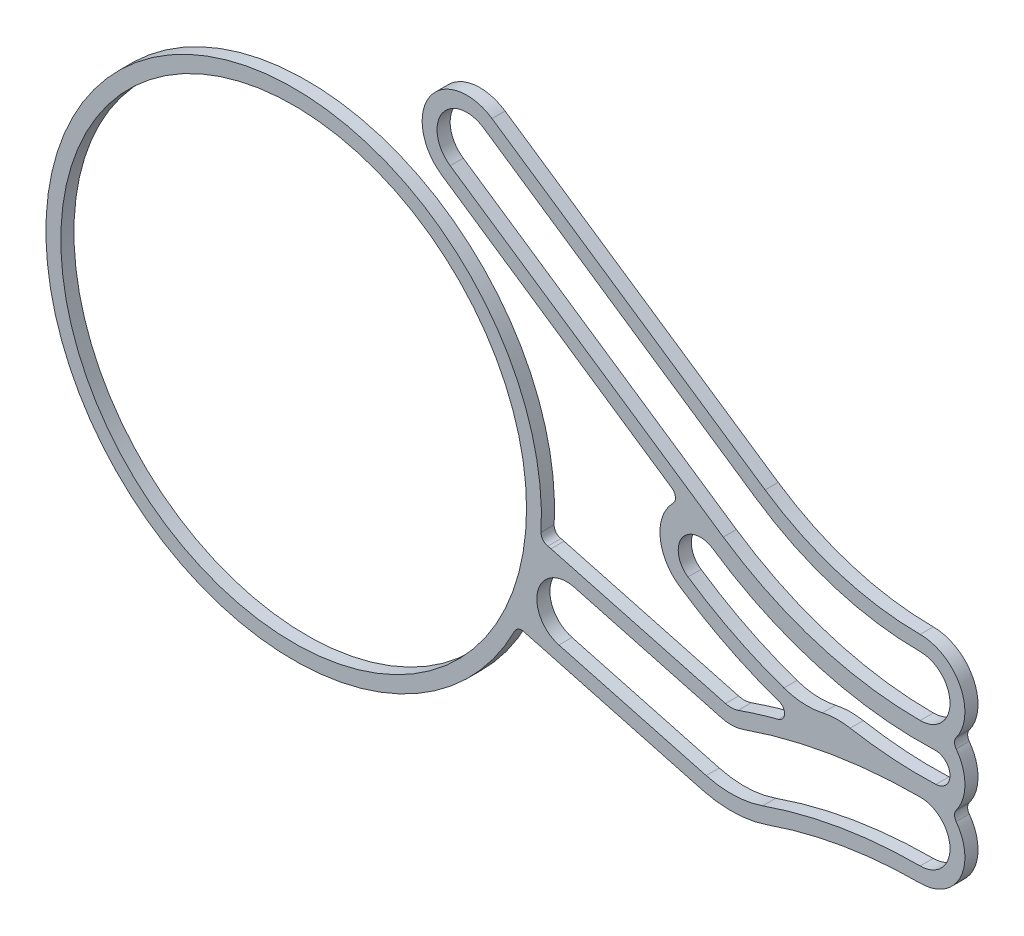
ISO-10303-21;
HEADER;
FILE_DESCRIPTION(('STEP AP214'),'2;1');
FILE_NAME('part.step','',(''),(''),'','','');
FILE_SCHEMA(('AUTOMOTIVE_DESIGN { 1 0 10303 214 1 1 1 1 }'));
ENDSEC;
DATA;
#1=APPLICATION_CONTEXT('core data for automotive mechanical design processes');
#2=APPLICATION_PROTOCOL_DEFINITION('international standard','automotive_design',2000,#1);
#3=PRODUCT_CONTEXT('',#1,'mechanical');
#4=PRODUCT('Part','Part','',(#3));
#5=PRODUCT_RELATED_PRODUCT_CATEGORY('part','',(#4));
#6=PRODUCT_DEFINITION_FORMATION('','',#4);
#7=PRODUCT_DEFINITION_CONTEXT('part definition',#1,'design');
#8=PRODUCT_DEFINITION('design','',#6,#7);
#9=PRODUCT_DEFINITION_SHAPE('','',#8);
#10=(LENGTH_UNIT() NAMED_UNIT(*) SI_UNIT(.MILLI.,.METRE.));
#11=(NAMED_UNIT(*) PLANE_ANGLE_UNIT() SI_UNIT($,.RADIAN.));
#12=(NAMED_UNIT(*) SI_UNIT($,.STERADIAN.) SOLID_ANGLE_UNIT());
#13=UNCERTAINTY_MEASURE_WITH_UNIT(LENGTH_MEASURE(1.E-05),#10,'distance_accuracy_value','');
#14=(GEOMETRIC_REPRESENTATION_CONTEXT(3) GLOBAL_UNCERTAINTY_ASSIGNED_CONTEXT((#13)) GLOBAL_UNIT_ASSIGNED_CONTEXT((#10,
#11,#12)) REPRESENTATION_CONTEXT('',''));
#15=CARTESIAN_POINT('',(0.,0.,0.));
#16=DIRECTION('',(0.,0.,1.));
#17=DIRECTION('',(1.,0.,0.));
#18=AXIS2_PLACEMENT_3D('',#15,#16,#17);
#19=CARTESIAN_POINT('',(56.,-53.0213758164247,-1.79));
#20=DIRECTION('',(0.,0.,-1.));
#21=DIRECTION('',(-1.,0.,0.));
#22=AXIS2_PLACEMENT_3D('',#19,#20,#21);
#23=PLANE('',#22);
#24=CARTESIAN_POINT('',(56.,-53.0213758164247,-1.79));
#25=DIRECTION('',(0.,0.,1.));
#26=DIRECTION('',(-1.,0.,0.));
#27=AXIS2_PLACEMENT_3D('',#24,#25,#26);
#28=CIRCLE('',#27,22.2960845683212);
#29=CARTESIAN_POINT('',(43.4949825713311,-71.4805178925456,-1.79));
#30=VERTEX_POINT('',#29);
#31=CARTESIAN_POINT('',(56.8823546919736,-75.2999942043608,-1.79));
#32=VERTEX_POINT('',#31);
#33=EDGE_CURVE('E391',#30,#32,#28,.T.);
#34=ORIENTED_EDGE('',*,*,#33,.F.);
#35=CARTESIAN_POINT('',(42.7427158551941,-72.5909680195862,-1.79));
#36=DIRECTION('',(0.,0.,-1.));
#37=DIRECTION('',(1.,0.,0.));
#38=AXIS2_PLACEMENT_3D('',#35,#36,#37);
#39=CIRCLE('',#38,1.34126980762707);
#40=CARTESIAN_POINT('',(41.9904491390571,-73.7014181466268,-1.79));
#41=VERTEX_POINT('',#40);
#42=EDGE_CURVE('E389',#41,#30,#39,.T.);
#43=ORIENTED_EDGE('',*,*,#42,.F.);
#44=CARTESIAN_POINT('',(56.,-53.0213758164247,-1.79));
#45=DIRECTION('',(0.,0.,-1.));
#46=DIRECTION('',(-1.,0.,0.));
#47=AXIS2_PLACEMENT_3D('',#44,#45,#46);
#48=CIRCLE('',#47,24.9786241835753);
#49=CARTESIAN_POINT('',(47.7801854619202,-76.6087943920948,-1.79));
#50=VERTEX_POINT('',#49);
#51=EDGE_CURVE('E403',#50,#41,#48,.T.);
#52=ORIENTED_EDGE('',*,*,#51,.F.);
#53=CARTESIAN_POINT('',(49.1835121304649,-72.581835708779,-1.79));
#54=DIRECTION('',(0.,0.,-1.));
#55=DIRECTION('',(-1.,0.,0.));
#56=AXIS2_PLACEMENT_3D('',#53,#54,#55);
#57=CIRCLE('',#56,4.26447206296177);
#58=CARTESIAN_POINT('',(50.1079001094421,-76.7449149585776,-1.79));
#59=VERTEX_POINT('',#58);
#60=EDGE_CURVE('E400',#59,#50,#57,.T.);
#61=ORIENTED_EDGE('',*,*,#60,.F.);
#62=CARTESIAN_POINT('',(51.0322880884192,-80.9079942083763,-1.79));
#63=DIRECTION('',(0.,0.,1.));
#64=DIRECTION('',(1.,0.,0.));
#65=AXIS2_PLACEMENT_3D('',#62,#63,#64);
#66=CIRCLE('',#65,4.26447206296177);
#67=CARTESIAN_POINT('',(51.7801854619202,-76.7096169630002,-1.79));
#68=VERTEX_POINT('',#67);
#69=EDGE_CURVE('E398',#68,#59,#66,.T.);
#70=ORIENTED_EDGE('',*,*,#69,.F.);
#71=CARTESIAN_POINT('',(56.,-53.0213758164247,-1.79));
#72=DIRECTION('',(0.,0.,-1.));
#73=DIRECTION('',(-1.,0.,0.));
#74=AXIS2_PLACEMENT_3D('',#71,#72,#73);
#75=CIRCLE('',#74,24.0611637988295);
#76=CARTESIAN_POINT('',(56.9522066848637,-77.0636907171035,-1.79));
#77=VERTEX_POINT('',#76);
#78=EDGE_CURVE('E396',#77,#68,#75,.T.);
#79=ORIENTED_EDGE('',*,*,#78,.F.);
#80=CARTESIAN_POINT('',(56.9172806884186,-76.1818424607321,-1.79));
#81=DIRECTION('',(0.,0.,-1.));
#82=DIRECTION('',(-1.,0.,0.));
#83=AXIS2_PLACEMENT_3D('',#80,#81,#82);
#84=CIRCLE('',#83,0.882539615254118);
#85=EDGE_CURVE('E394',#32,#77,#84,.T.);
#86=ORIENTED_EDGE('',*,*,#85,.F.);
#87=EDGE_LOOP('',(#34,#43,#52,#61,#70,#79,#86));
#88=FACE_BOUND('',#87,.T.);
#89=DIRECTION('',(0.96592582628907,-0.258819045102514,0.));
#90=VECTOR('',#89,1.);
#91=CARTESIAN_POINT('',(35.1349096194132,-77.6741982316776,-1.79));
#92=LINE('',#91,#90);
#93=CARTESIAN_POINT('',(35.1349096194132,-77.6741982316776,-1.79));
#94=VERTEX_POINT('',#93);
#95=CARTESIAN_POINT('',(44.0214272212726,-80.0553334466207,-1.79));
#96=VERTEX_POINT('',#95);
#97=EDGE_CURVE('E443',#94,#96,#92,.T.);
#98=ORIENTED_EDGE('',*,*,#97,.F.);
#99=CARTESIAN_POINT('',(34.6690353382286,-79.4128647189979,-1.79));
#100=DIRECTION('',(0.,0.,-1.));
#101=DIRECTION('',(1.,0.,0.));
#102=AXIS2_PLACEMENT_3D('',#99,#100,#101);
#103=CIRCLE('',#102,1.8);
#104=CARTESIAN_POINT('',(34.2031610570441,-81.1515312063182,-1.79));
#105=VERTEX_POINT('',#104);
#106=EDGE_CURVE('E441',#105,#94,#103,.T.);
#107=ORIENTED_EDGE('',*,*,#106,.F.);
#108=DIRECTION('',(-0.965925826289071,0.258819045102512,0.));
#109=VECTOR('',#108,1.);
#110=CARTESIAN_POINT('',(43.0896786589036,-83.5326664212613,-1.79));
#111=LINE('',#110,#109);
#112=CARTESIAN_POINT('',(43.0896786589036,-83.5326664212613,-1.79));
#113=VERTEX_POINT('',#112);
#114=EDGE_CURVE('E457',#113,#105,#111,.T.);
#115=ORIENTED_EDGE('',*,*,#114,.F.);
#116=CARTESIAN_POINT('',(44.5908291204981,-77.9302966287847,-1.79));
#117=DIRECTION('',(0.,0.,-1.));
#118=DIRECTION('',(-1.,0.,0.));
#119=AXIS2_PLACEMENT_3D('',#116,#117,#118);
#120=CIRCLE('',#119,5.79999999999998);
#121=CARTESIAN_POINT('',(46.498796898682,-83.4074910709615,-1.79));
#122=VERTEX_POINT('',#121);
#123=EDGE_CURVE('E454',#122,#113,#120,.T.);
#124=ORIENTED_EDGE('',*,*,#123,.F.);
#125=CARTESIAN_POINT('',(56.,-110.682551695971,-1.79));
#126=DIRECTION('',(0.,0.,1.));
#127=DIRECTION('',(-1.,0.,0.));
#128=AXIS2_PLACEMENT_3D('',#125,#126,#127);
#129=CIRCLE('',#128,28.8825516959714);
#130=CARTESIAN_POINT('',(56.0000000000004,-81.8,-1.79));
#131=VERTEX_POINT('',#130);
#132=EDGE_CURVE('E452',#131,#122,#129,.T.);
#133=ORIENTED_EDGE('',*,*,#132,.F.);
#134=CARTESIAN_POINT('',(56.0000000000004,-80.,-1.79));
#135=DIRECTION('',(0.,0.,-1.));
#136=DIRECTION('',(-1.,0.,0.));
#137=AXIS2_PLACEMENT_3D('',#134,#135,#136);
#138=CIRCLE('',#137,1.80000000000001);
#139=CARTESIAN_POINT('',(56.0000000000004,-78.2,-1.79));
#140=VERTEX_POINT('',#139);
#141=EDGE_CURVE('E450',#140,#131,#138,.T.);
#142=ORIENTED_EDGE('',*,*,#141,.F.);
#143=CARTESIAN_POINT('',(56.,-110.682551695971,-1.79));
#144=DIRECTION('',(0.,0.,-1.));
#145=DIRECTION('',(-1.,0.,0.));
#146=AXIS2_PLACEMENT_3D('',#143,#144,#145);
#147=CIRCLE('',#146,32.4825516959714);
#148=CARTESIAN_POINT('',(45.314541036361,-80.0078531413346,-1.79));
#149=VERTEX_POINT('',#148);
#150=EDGE_CURVE('E448',#149,#140,#147,.T.);
#151=ORIENTED_EDGE('',*,*,#150,.F.);
#152=CARTESIAN_POINT('',(44.5908291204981,-77.9302966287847,-1.79));
#153=DIRECTION('',(0.,0.,1.));
#154=DIRECTION('',(-1.,0.,0.));
#155=AXIS2_PLACEMENT_3D('',#152,#153,#154);
#156=CIRCLE('',#155,2.19999999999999);
#157=EDGE_CURVE('E446',#96,#149,#156,.T.);
#158=ORIENTED_EDGE('',*,*,#157,.F.);
#159=EDGE_LOOP('',(#98,#107,#115,#124,#133,#142,#151,#158));
#160=FACE_BOUND('',#159,.T.);
#161=CARTESIAN_POINT('',(56.,-53.0213758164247,-1.79));
#162=DIRECTION('',(0.,0.,-1.));
#163=DIRECTION('',(-1.,0.,0.));
#164=AXIS2_PLACEMENT_3D('',#161,#162,#163);
#165=CIRCLE('',#164,25.8786241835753);
#166=CARTESIAN_POINT('',(47.4840189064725,-77.4586681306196,-1.79));
#167=VERTEX_POINT('',#166);
#168=CARTESIAN_POINT('',(41.4856737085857,-74.4465367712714,-1.79));
#169=VERTEX_POINT('',#168);
#170=EDGE_CURVE('E500',#167,#169,#165,.T.);
#171=ORIENTED_EDGE('',*,*,#170,.T.);
#172=CARTESIAN_POINT('',(43.,-72.2111808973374,-1.79));
#173=DIRECTION('',(0.,0.,-1.));
#174=DIRECTION('',(-1.,0.,0.));
#175=AXIS2_PLACEMENT_3D('',#172,#173,#174);
#176=CIRCLE('',#175,2.7);
#177=CARTESIAN_POINT('',(41.0882252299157,-70.3045825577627,-1.79));
#178=VERTEX_POINT('',#177);
#179=EDGE_CURVE('E503',#169,#178,#176,.T.);
#180=ORIENTED_EDGE('',*,*,#179,.T.);
#181=CARTESIAN_POINT('',(40.7341928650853,-69.9515087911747,-1.79));
#182=DIRECTION('',(0.,0.,1.));
#183=DIRECTION('',(-1.,0.,0.));
#184=AXIS2_PLACEMENT_3D('',#181,#182,#183);
#185=CIRCLE('',#184,0.500000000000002);
#186=CARTESIAN_POINT('',(41.0146236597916,-69.5375539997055,-1.79));
#187=VERTEX_POINT('',#186);
#188=EDGE_CURVE('E506',#178,#187,#185,.T.);
#189=ORIENTED_EDGE('',*,*,#188,.T.);
#190=DIRECTION('',(-0.827909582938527,0.560861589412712,0.));
#191=VECTOR('',#190,1.);
#192=CARTESIAN_POINT('',(41.0146236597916,-69.5375539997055,-1.79));
#193=LINE('',#192,#191);
#194=CARTESIAN_POINT('',(27.1356737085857,-60.135355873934,-1.79));
#195=VERTEX_POINT('',#194);
#196=EDGE_CURVE('E508',#187,#195,#193,.T.);
#197=ORIENTED_EDGE('',*,*,#196,.T.);
#198=CARTESIAN_POINT('',(28.65,-57.9,-1.79));
#199=DIRECTION('',(0.,0.,-1.));
#200=DIRECTION('',(-1.,0.,0.));
#201=AXIS2_PLACEMENT_3D('',#198,#199,#200);
#202=CIRCLE('',#201,2.7);
#203=CARTESIAN_POINT('',(30.1643262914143,-55.664644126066,-1.79));
#204=VERTEX_POINT('',#203);
#205=EDGE_CURVE('E510',#195,#204,#202,.T.);
#206=ORIENTED_EDGE('',*,*,#205,.T.);
#207=DIRECTION('',(0.827909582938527,-0.560861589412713,0.));
#208=VECTOR('',#207,1.);
#209=CARTESIAN_POINT('',(30.1643262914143,-55.664644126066,-1.79));
#210=LINE('',#209,#208);
#211=CARTESIAN_POINT('',(46.6456003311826,-66.829768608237,-1.79));
#212=VERTEX_POINT('',#211);
#213=EDGE_CURVE('E512',#204,#212,#210,.T.);
#214=ORIENTED_EDGE('',*,*,#213,.T.);
#215=CARTESIAN_POINT('',(56.,-53.0213758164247,-1.79));
#216=DIRECTION('',(0.,0.,1.));
#217=DIRECTION('',(-1.,0.,0.));
#218=AXIS2_PLACEMENT_3D('',#215,#216,#217);
#219=CIRCLE('',#218,16.6786241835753);
#220=CARTESIAN_POINT('',(56.,-69.7,-1.79));
#221=VERTEX_POINT('',#220);
#222=EDGE_CURVE('E514',#212,#221,#219,.T.);
#223=ORIENTED_EDGE('',*,*,#222,.T.);
#224=CARTESIAN_POINT('',(56.,-72.4,-1.79));
#225=DIRECTION('',(0.,0.,-1.));
#226=DIRECTION('',(-1.,0.,0.));
#227=AXIS2_PLACEMENT_3D('',#224,#225,#226);
#228=CIRCLE('',#227,2.7);
#229=CARTESIAN_POINT('',(58.1725538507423,-74.003125,-1.79));
#230=VERTEX_POINT('',#229);
#231=EDGE_CURVE('E516',#221,#230,#228,.T.);
#232=ORIENTED_EDGE('',*,*,#231,.T.);
#233=CARTESIAN_POINT('',(58.5748786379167,-74.3,-1.79));
#234=DIRECTION('',(0.,0.,1.));
#235=DIRECTION('',(-1.,0.,0.));
#236=AXIS2_PLACEMENT_3D('',#233,#234,#235);
#237=CIRCLE('',#236,0.499999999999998);
#238=CARTESIAN_POINT('',(58.1725538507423,-74.596875,-1.79));
#239=VERTEX_POINT('',#238);
#240=EDGE_CURVE('E518',#230,#239,#237,.T.);
#241=ORIENTED_EDGE('',*,*,#240,.T.);
#242=CARTESIAN_POINT('',(56.,-76.2,-1.79));
#243=DIRECTION('',(0.,0.,-1.));
#244=DIRECTION('',(-1.,0.,0.));
#245=AXIS2_PLACEMENT_3D('',#242,#243,#244);
#246=CIRCLE('',#245,2.70000000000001);
#247=CARTESIAN_POINT('',(58.1725538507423,-77.8031249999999,-1.79));
#248=VERTEX_POINT('',#247);
#249=EDGE_CURVE('E520',#239,#248,#246,.T.);
#250=ORIENTED_EDGE('',*,*,#249,.T.);
#251=CARTESIAN_POINT('',(58.5748786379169,-78.0999999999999,-1.79));
#252=DIRECTION('',(0.,0.,1.));
#253=DIRECTION('',(-1.,0.,0.));
#254=AXIS2_PLACEMENT_3D('',#251,#252,#253);
#255=CIRCLE('',#254,0.500000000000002);
#256=CARTESIAN_POINT('',(58.1725538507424,-78.3968749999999,-1.79));
#257=VERTEX_POINT('',#256);
#258=EDGE_CURVE('E522',#248,#257,#255,.T.);
#259=ORIENTED_EDGE('',*,*,#258,.T.);
#260=CARTESIAN_POINT('',(56.,-80.,-1.79));
#261=DIRECTION('',(0.,0.,-1.));
#262=DIRECTION('',(-1.,0.,0.));
#263=AXIS2_PLACEMENT_3D('',#260,#261,#262);
#264=CIRCLE('',#263,2.70000000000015);
#265=CARTESIAN_POINT('',(56.0000000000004,-82.7000000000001,-1.79));
#266=VERTEX_POINT('',#265);
#267=EDGE_CURVE('E524',#257,#266,#264,.T.);
#268=ORIENTED_EDGE('',*,*,#267,.T.);
#269=CARTESIAN_POINT('',(56.,-110.682551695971,-1.79));
#270=DIRECTION('',(0.,0.,1.));
#271=DIRECTION('',(-1.,0.,0.));
#272=AXIS2_PLACEMENT_3D('',#269,#270,#271);
#273=CIRCLE('',#272,27.9825516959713);
#274=CARTESIAN_POINT('',(46.7948608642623,-84.2574005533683,-1.79));
#275=VERTEX_POINT('',#274);
#276=EDGE_CURVE('E526',#266,#275,#273,.T.);
#277=ORIENTED_EDGE('',*,*,#276,.T.);
#278=CARTESIAN_POINT('',(44.5908291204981,-77.9302966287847,-1.79));
#279=DIRECTION('',(0.,0.,-1.));
#280=DIRECTION('',(-1.,0.,0.));
#281=AXIS2_PLACEMENT_3D('',#278,#279,#280);
#282=CIRCLE('',#281,6.70000000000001);
#283=CARTESIAN_POINT('',(42.8567415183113,-84.4019996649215,-1.79));
#284=VERTEX_POINT('',#283);
#285=EDGE_CURVE('E528',#275,#284,#282,.T.);
#286=ORIENTED_EDGE('',*,*,#285,.T.);
#287=DIRECTION('',(-0.965925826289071,0.258819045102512,0.));
#288=VECTOR('',#287,1.);
#289=CARTESIAN_POINT('',(42.8567415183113,-84.4019996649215,-1.79));
#290=LINE('',#289,#288);
#291=CARTESIAN_POINT('',(32.3281500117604,-81.5808720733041,-1.79));
#292=VERTEX_POINT('',#291);
#293=EDGE_CURVE('E530',#284,#292,#290,.T.);
#294=ORIENTED_EDGE('',*,*,#293,.T.);
#295=CARTESIAN_POINT('',(33.0269614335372,-78.9728723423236,-1.79));
#296=DIRECTION('',(0.,0.,-1.));
#297=DIRECTION('',(-1.,0.,0.));
#298=AXIS2_PLACEMENT_3D('',#295,#296,#297);
#299=CIRCLE('',#298,2.7);
#300=CARTESIAN_POINT('',(32.1399303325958,-81.5230048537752,-1.79));
#301=VERTEX_POINT('',#300);
#302=EDGE_CURVE('E532',#292,#301,#299,.T.);
#303=ORIENTED_EDGE('',*,*,#302,.T.);
#304=CARTESIAN_POINT('',(31.9756653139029,-81.9952516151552,-1.79));
#305=DIRECTION('',(0.,0.,1.));
#306=DIRECTION('',(-1.,0.,0.));
#307=AXIS2_PLACEMENT_3D('',#304,#305,#306);
#308=CIRCLE('',#307,0.500000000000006);
#309=CARTESIAN_POINT('',(31.5298509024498,-81.7688680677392,-1.79));
#310=VERTEX_POINT('',#309);
#311=EDGE_CURVE('E534',#301,#310,#308,.T.);
#312=ORIENTED_EDGE('',*,*,#311,.T.);
#313=CARTESIAN_POINT('',(18.2,-75.,-1.79));
#314=DIRECTION('',(0.,0.,-1.));
#315=DIRECTION('',(-1.,0.,0.));
#316=AXIS2_PLACEMENT_3D('',#313,#314,#315);
#317=CIRCLE('',#316,14.95);
#318=CARTESIAN_POINT('',(33.12842354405,-75.8029137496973,-1.79));
#319=VERTEX_POINT('',#318);
#320=EDGE_CURVE('E536',#310,#319,#317,.T.);
#321=ORIENTED_EDGE('',*,*,#320,.T.);
#322=CARTESIAN_POINT('',(33.6277019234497,-75.8297670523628,-1.79));
#323=DIRECTION('',(0.,0.,1.));
#324=DIRECTION('',(-1.,0.,0.));
#325=AXIS2_PLACEMENT_3D('',#322,#323,#324);
#326=CIRCLE('',#325,0.500000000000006);
#327=CARTESIAN_POINT('',(33.5338362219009,-76.3208772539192,-1.79));
#328=VERTEX_POINT('',#327);
#329=EDGE_CURVE('E538',#319,#328,#326,.T.);
#330=ORIENTED_EDGE('',*,*,#329,.T.);
#331=CARTESIAN_POINT('',(33.0269614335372,-78.9728723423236,-1.79));
#332=DIRECTION('',(0.,0.,-1.));
#333=DIRECTION('',(-1.,0.,0.));
#334=AXIS2_PLACEMENT_3D('',#331,#332,#333);
#335=CIRCLE('',#334,2.69999999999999);
#336=CARTESIAN_POINT('',(33.725772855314,-76.3648726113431,-1.79));
#337=VERTEX_POINT('',#336);
#338=EDGE_CURVE('E540',#328,#337,#335,.T.);
#339=ORIENTED_EDGE('',*,*,#338,.T.);
#340=DIRECTION('',(0.965925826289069,-0.258819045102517,0.));
#341=VECTOR('',#340,1.);
#342=CARTESIAN_POINT('',(33.725772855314,-76.3648726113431,-1.79));
#343=LINE('',#342,#341);
#344=CARTESIAN_POINT('',(44.2543643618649,-79.1860002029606,-1.79));
#345=VERTEX_POINT('',#344);
#346=EDGE_CURVE('E542',#337,#345,#343,.T.);
#347=ORIENTED_EDGE('',*,*,#346,.T.);
#348=CARTESIAN_POINT('',(44.5908291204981,-77.9302966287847,-1.79));
#349=DIRECTION('',(0.,0.,1.));
#350=DIRECTION('',(-1.,0.,0.));
#351=AXIS2_PLACEMENT_3D('',#348,#349,#350);
#352=CIRCLE('',#351,1.30000000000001);
#353=CARTESIAN_POINT('',(45.0184770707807,-79.1579436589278,-1.79));
#354=VERTEX_POINT('',#353);
#355=EDGE_CURVE('E544',#345,#354,#352,.T.);
#356=ORIENTED_EDGE('',*,*,#355,.T.);
#357=CARTESIAN_POINT('',(56.,-110.682551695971,-1.79));
#358=DIRECTION('',(0.,0.,-1.));
#359=DIRECTION('',(-1.,0.,0.));
#360=AXIS2_PLACEMENT_3D('',#357,#358,#359);
#361=CIRCLE('',#360,33.3825516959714);
#362=CARTESIAN_POINT('',(47.4475791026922,-78.4141328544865,-1.79));
#363=VERTEX_POINT('',#362);
#364=EDGE_CURVE('E546',#354,#363,#361,.T.);
#365=ORIENTED_EDGE('',*,*,#364,.T.);
#366=CARTESIAN_POINT('',(47.3194819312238,-77.9308202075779,-1.79));
#367=DIRECTION('',(0.,0.,1.));
#368=DIRECTION('',(-1.,0.,0.));
#369=AXIS2_PLACEMENT_3D('',#366,#367,#368);
#370=CIRCLE('',#369,0.500000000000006);
#371=EDGE_CURVE('E548',#363,#167,#370,.T.);
#372=ORIENTED_EDGE('',*,*,#371,.T.);
#373=EDGE_LOOP('',(#171,#180,#189,#197,#206,#214,#223,#232,#241,#250,#259,#268,#277,#286,#294,
#303,#312,#321,#330,#339,#347,#356,#365,#372));
#374=FACE_BOUND('',#373,.T.);
#375=CARTESIAN_POINT('',(18.2,-75.,-1.79));
#376=DIRECTION('',(0.,0.,-1.));
#377=DIRECTION('',(-1.,0.,0.));
#378=AXIS2_PLACEMENT_3D('',#375,#376,#377);
#379=CIRCLE('',#378,14.05);
#380=CARTESIAN_POINT('',(32.25,-75.,-1.79));
#381=VERTEX_POINT('',#380);
#382=EDGE_CURVE('E383',#381,#381,#379,.T.);
#383=ORIENTED_EDGE('',*,*,#382,.F.);
#384=EDGE_LOOP('',(#383));
#385=FACE_BOUND('',#384,.T.);
#386=CARTESIAN_POINT('',(56.,-53.0213758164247,-1.79));
#387=DIRECTION('',(0.,0.,-1.));
#388=DIRECTION('',(-1.,0.,0.));
#389=AXIS2_PLACEMENT_3D('',#386,#387,#388);
#390=CIRCLE('',#389,21.1786241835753);
#391=CARTESIAN_POINT('',(56.,-74.2,-1.79));
#392=VERTEX_POINT('',#391);
#393=CARTESIAN_POINT('',(44.1217231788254,-70.5553617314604,-1.79));
#394=VERTEX_POINT('',#393);
#395=EDGE_CURVE('E340',#392,#394,#390,.T.);
#396=ORIENTED_EDGE('',*,*,#395,.F.);
#397=CARTESIAN_POINT('',(56.,-72.4,-1.79));
#398=DIRECTION('',(0.,0.,-1.));
#399=DIRECTION('',(-1.,0.,0.));
#400=AXIS2_PLACEMENT_3D('',#397,#398,#399);
#401=CIRCLE('',#400,1.8);
#402=CARTESIAN_POINT('',(56.,-70.6,-1.79));
#403=VERTEX_POINT('',#402);
#404=EDGE_CURVE('E332',#403,#392,#401,.T.);
#405=ORIENTED_EDGE('',*,*,#404,.F.);
#406=CARTESIAN_POINT('',(56.,-53.0213758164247,-1.79));
#407=DIRECTION('',(0.,0.,1.));
#408=DIRECTION('',(-1.,0.,0.));
#409=AXIS2_PLACEMENT_3D('',#406,#407,#408);
#410=CIRCLE('',#409,17.5786241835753);
#411=CARTESIAN_POINT('',(46.1408249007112,-67.5748872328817,-1.79));
#412=VERTEX_POINT('',#411);
#413=EDGE_CURVE('E361',#412,#403,#410,.T.);
#414=ORIENTED_EDGE('',*,*,#413,.F.);
#415=DIRECTION('',(0.827909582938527,-0.560861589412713,0.));
#416=VECTOR('',#415,1.);
#417=CARTESIAN_POINT('',(29.6595508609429,-56.4097627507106,-1.79));
#418=LINE('',#417,#416);
#419=CARTESIAN_POINT('',(29.6595508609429,-56.4097627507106,-1.79));
#420=VERTEX_POINT('',#419);
#421=EDGE_CURVE('E359',#420,#412,#418,.T.);
#422=ORIENTED_EDGE('',*,*,#421,.F.);
#423=CARTESIAN_POINT('',(28.65,-57.9,-1.79));
#424=DIRECTION('',(0.,0.,-1.));
#425=DIRECTION('',(-1.,0.,0.));
#426=AXIS2_PLACEMENT_3D('',#423,#424,#425);
#427=CIRCLE('',#426,1.8);
#428=CARTESIAN_POINT('',(27.6404491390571,-59.3902372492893,-1.79));
#429=VERTEX_POINT('',#428);
#430=EDGE_CURVE('E355',#429,#420,#427,.T.);
#431=ORIENTED_EDGE('',*,*,#430,.F.);
#432=DIRECTION('',(-0.827909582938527,0.560861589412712,0.));
#433=VECTOR('',#432,1.);
#434=CARTESIAN_POINT('',(44.1217231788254,-70.5553617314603,-1.79));
#435=LINE('',#434,#433);
#436=EDGE_CURVE('E353',#394,#429,#435,.T.);
#437=ORIENTED_EDGE('',*,*,#436,.F.);
#438=EDGE_LOOP('',(#396,#405,#414,#422,#431,#437));
#439=FACE_BOUND('',#438,.T.);
#440=ADVANCED_FACE('F45',(#88,#160,#374,#385,#439),#23,.T.);
#441=CARTESIAN_POINT('',(56.,-53.0213758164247,-1.));
#442=DIRECTION('',(0.,0.,-1.));
#443=DIRECTION('',(-1.,0.,0.));
#444=AXIS2_PLACEMENT_3D('',#441,#442,#443);
#445=PLANE('',#444);
#446=CARTESIAN_POINT('',(18.2,-75.,-1.));
#447=DIRECTION('',(0.,0.,-1.));
#448=DIRECTION('',(-1.,0.,0.));
#449=AXIS2_PLACEMENT_3D('',#446,#447,#448);
#450=CIRCLE('',#449,14.05);
#451=CARTESIAN_POINT('',(32.25,-75.,-1.));
#452=VERTEX_POINT('',#451);
#453=EDGE_CURVE('E348',#452,#452,#450,.T.);
#454=ORIENTED_EDGE('',*,*,#453,.T.);
#455=EDGE_LOOP('',(#454));
#456=FACE_BOUND('',#455,.T.);
#457=CARTESIAN_POINT('',(42.7427158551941,-72.5909680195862,-1.));
#458=DIRECTION('',(0.,0.,-1.));
#459=DIRECTION('',(1.,0.,0.));
#460=AXIS2_PLACEMENT_3D('',#457,#458,#459);
#461=CIRCLE('',#460,1.34126980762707);
#462=CARTESIAN_POINT('',(41.9904491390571,-73.7014181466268,-1.));
#463=VERTEX_POINT('',#462);
#464=CARTESIAN_POINT('',(43.4949825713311,-71.4805178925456,-1.));
#465=VERTEX_POINT('',#464);
#466=EDGE_CURVE('E386',#463,#465,#461,.T.);
#467=ORIENTED_EDGE('',*,*,#466,.T.);
#468=CARTESIAN_POINT('',(56.,-53.0213758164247,-1.));
#469=DIRECTION('',(0.,0.,1.));
#470=DIRECTION('',(-1.,0.,0.));
#471=AXIS2_PLACEMENT_3D('',#468,#469,#470);
#472=CIRCLE('',#471,22.2960845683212);
#473=CARTESIAN_POINT('',(56.8823546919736,-75.2999942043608,-1.));
#474=VERTEX_POINT('',#473);
#475=EDGE_CURVE('E408',#465,#474,#472,.T.);
#476=ORIENTED_EDGE('',*,*,#475,.T.);
#477=CARTESIAN_POINT('',(56.9172806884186,-76.1818424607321,-1.));
#478=DIRECTION('',(0.,0.,-1.));
#479=DIRECTION('',(-1.,0.,0.));
#480=AXIS2_PLACEMENT_3D('',#477,#478,#479);
#481=CIRCLE('',#480,0.882539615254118);
#482=CARTESIAN_POINT('',(56.9522066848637,-77.0636907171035,-1.));
#483=VERTEX_POINT('',#482);
#484=EDGE_CURVE('E411',#474,#483,#481,.T.);
#485=ORIENTED_EDGE('',*,*,#484,.T.);
#486=CARTESIAN_POINT('',(56.,-53.0213758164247,-1.));
#487=DIRECTION('',(0.,0.,-1.));
#488=DIRECTION('',(-1.,0.,0.));
#489=AXIS2_PLACEMENT_3D('',#486,#487,#488);
#490=CIRCLE('',#489,24.0611637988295);
#491=CARTESIAN_POINT('',(51.7801854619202,-76.7096169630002,-1.));
#492=VERTEX_POINT('',#491);
#493=EDGE_CURVE('E414',#483,#492,#490,.T.);
#494=ORIENTED_EDGE('',*,*,#493,.T.);
#495=CARTESIAN_POINT('',(51.0322880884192,-80.9079942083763,-1.));
#496=DIRECTION('',(0.,0.,1.));
#497=DIRECTION('',(1.,0.,0.));
#498=AXIS2_PLACEMENT_3D('',#495,#496,#497);
#499=CIRCLE('',#498,4.26447206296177);
#500=CARTESIAN_POINT('',(50.1079001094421,-76.7449149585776,-1.));
#501=VERTEX_POINT('',#500);
#502=EDGE_CURVE('E417',#492,#501,#499,.T.);
#503=ORIENTED_EDGE('',*,*,#502,.T.);
#504=CARTESIAN_POINT('',(49.1835121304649,-72.581835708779,-1.));
#505=DIRECTION('',(0.,0.,-1.));
#506=DIRECTION('',(-1.,0.,0.));
#507=AXIS2_PLACEMENT_3D('',#504,#505,#506);
#508=CIRCLE('',#507,4.26447206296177);
#509=CARTESIAN_POINT('',(47.7801854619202,-76.6087943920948,-1.));
#510=VERTEX_POINT('',#509);
#511=EDGE_CURVE('E420',#501,#510,#508,.T.);
#512=ORIENTED_EDGE('',*,*,#511,.T.);
#513=CARTESIAN_POINT('',(56.,-53.0213758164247,-1.));
#514=DIRECTION('',(0.,0.,-1.));
#515=DIRECTION('',(-1.,0.,0.));
#516=AXIS2_PLACEMENT_3D('',#513,#514,#515);
#517=CIRCLE('',#516,24.9786241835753);
#518=EDGE_CURVE('E392',#510,#463,#517,.T.);
#519=ORIENTED_EDGE('',*,*,#518,.T.);
#520=EDGE_LOOP('',(#467,#476,#485,#494,#503,#512,#519));
#521=FACE_BOUND('',#520,.T.);
#522=CARTESIAN_POINT('',(56.,-53.0213758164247,-1.));
#523=DIRECTION('',(0.,0.,-1.));
#524=DIRECTION('',(-1.,0.,0.));
#525=AXIS2_PLACEMENT_3D('',#522,#523,#524);
#526=CIRCLE('',#525,25.8786241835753);
#527=CARTESIAN_POINT('',(47.4840189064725,-77.4586681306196,-1.));
#528=VERTEX_POINT('',#527);
#529=CARTESIAN_POINT('',(41.4856737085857,-74.4465367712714,-1.));
#530=VERTEX_POINT('',#529);
#531=EDGE_CURVE('E499',#528,#530,#526,.T.);
#532=ORIENTED_EDGE('',*,*,#531,.F.);
#533=CARTESIAN_POINT('',(47.3194819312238,-77.9308202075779,-1.));
#534=DIRECTION('',(0.,0.,1.));
#535=DIRECTION('',(-1.,0.,0.));
#536=AXIS2_PLACEMENT_3D('',#533,#534,#535);
#537=CIRCLE('',#536,0.500000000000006);
#538=CARTESIAN_POINT('',(47.4475791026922,-78.4141328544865,-1.));
#539=VERTEX_POINT('',#538);
#540=EDGE_CURVE('E504',#539,#528,#537,.T.);
#541=ORIENTED_EDGE('',*,*,#540,.F.);
#542=CARTESIAN_POINT('',(56.,-110.682551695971,-1.));
#543=DIRECTION('',(0.,0.,-1.));
#544=DIRECTION('',(-1.,0.,0.));
#545=AXIS2_PLACEMENT_3D('',#542,#543,#544);
#546=CIRCLE('',#545,33.3825516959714);
#547=CARTESIAN_POINT('',(45.0184770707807,-79.1579436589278,-1.));
#548=VERTEX_POINT('',#547);
#549=EDGE_CURVE('E595',#548,#539,#546,.T.);
#550=ORIENTED_EDGE('',*,*,#549,.F.);
#551=CARTESIAN_POINT('',(44.5908291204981,-77.9302966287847,-1.));
#552=DIRECTION('',(0.,0.,1.));
#553=DIRECTION('',(-1.,0.,0.));
#554=AXIS2_PLACEMENT_3D('',#551,#552,#553);
#555=CIRCLE('',#554,1.30000000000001);
#556=CARTESIAN_POINT('',(44.2543643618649,-79.1860002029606,-1.));
#557=VERTEX_POINT('',#556);
#558=EDGE_CURVE('E593',#557,#548,#555,.T.);
#559=ORIENTED_EDGE('',*,*,#558,.F.);
#560=DIRECTION('',(0.965925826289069,-0.258819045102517,0.));
#561=VECTOR('',#560,1.);
#562=CARTESIAN_POINT('',(33.725772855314,-76.3648726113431,-1.));
#563=LINE('',#562,#561);
#564=CARTESIAN_POINT('',(33.725772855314,-76.3648726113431,-1.));
#565=VERTEX_POINT('',#564);
#566=EDGE_CURVE('E591',#565,#557,#563,.T.);
#567=ORIENTED_EDGE('',*,*,#566,.F.);
#568=CARTESIAN_POINT('',(33.0269614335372,-78.9728723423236,-1.));
#569=DIRECTION('',(0.,0.,-1.));
#570=DIRECTION('',(-1.,0.,0.));
#571=AXIS2_PLACEMENT_3D('',#568,#569,#570);
#572=CIRCLE('',#571,2.69999999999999);
#573=CARTESIAN_POINT('',(33.5338362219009,-76.3208772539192,-1.));
#574=VERTEX_POINT('',#573);
#575=EDGE_CURVE('E589',#574,#565,#572,.T.);
#576=ORIENTED_EDGE('',*,*,#575,.F.);
#577=CARTESIAN_POINT('',(33.6277019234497,-75.8297670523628,-1.));
#578=DIRECTION('',(0.,0.,1.));
#579=DIRECTION('',(-1.,0.,0.));
#580=AXIS2_PLACEMENT_3D('',#577,#578,#579);
#581=CIRCLE('',#580,0.500000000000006);
#582=CARTESIAN_POINT('',(33.12842354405,-75.8029137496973,-1.));
#583=VERTEX_POINT('',#582);
#584=EDGE_CURVE('E587',#583,#574,#581,.T.);
#585=ORIENTED_EDGE('',*,*,#584,.F.);
#586=CARTESIAN_POINT('',(18.2,-75.,-1.));
#587=DIRECTION('',(0.,0.,-1.));
#588=DIRECTION('',(-1.,0.,0.));
#589=AXIS2_PLACEMENT_3D('',#586,#587,#588);
#590=CIRCLE('',#589,14.95);
#591=CARTESIAN_POINT('',(31.5298509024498,-81.7688680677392,-1.));
#592=VERTEX_POINT('',#591);
#593=EDGE_CURVE('E585',#592,#583,#590,.T.);
#594=ORIENTED_EDGE('',*,*,#593,.F.);
#595=CARTESIAN_POINT('',(31.9756653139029,-81.9952516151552,-1.));
#596=DIRECTION('',(0.,0.,1.));
#597=DIRECTION('',(-1.,0.,0.));
#598=AXIS2_PLACEMENT_3D('',#595,#596,#597);
#599=CIRCLE('',#598,0.500000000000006);
#600=CARTESIAN_POINT('',(32.1399303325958,-81.5230048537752,-1.));
#601=VERTEX_POINT('',#600);
#602=EDGE_CURVE('E583',#601,#592,#599,.T.);
#603=ORIENTED_EDGE('',*,*,#602,.F.);
#604=CARTESIAN_POINT('',(33.0269614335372,-78.9728723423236,-1.));
#605=DIRECTION('',(0.,0.,-1.));
#606=DIRECTION('',(-1.,0.,0.));
#607=AXIS2_PLACEMENT_3D('',#604,#605,#606);
#608=CIRCLE('',#607,2.7);
#609=CARTESIAN_POINT('',(32.3281500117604,-81.5808720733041,-1.));
#610=VERTEX_POINT('',#609);
#611=EDGE_CURVE('E581',#610,#601,#608,.T.);
#612=ORIENTED_EDGE('',*,*,#611,.F.);
#613=DIRECTION('',(-0.965925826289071,0.258819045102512,0.));
#614=VECTOR('',#613,1.);
#615=CARTESIAN_POINT('',(42.8567415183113,-84.4019996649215,-1.));
#616=LINE('',#615,#614);
#617=CARTESIAN_POINT('',(42.8567415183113,-84.4019996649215,-1.));
#618=VERTEX_POINT('',#617);
#619=EDGE_CURVE('E579',#618,#610,#616,.T.);
#620=ORIENTED_EDGE('',*,*,#619,.F.);
#621=CARTESIAN_POINT('',(44.5908291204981,-77.9302966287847,-1.));
#622=DIRECTION('',(0.,0.,-1.));
#623=DIRECTION('',(-1.,0.,0.));
#624=AXIS2_PLACEMENT_3D('',#621,#622,#623);
#625=CIRCLE('',#624,6.70000000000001);
#626=CARTESIAN_POINT('',(46.7948608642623,-84.2574005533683,-1.));
#627=VERTEX_POINT('',#626);
#628=EDGE_CURVE('E577',#627,#618,#625,.T.);
#629=ORIENTED_EDGE('',*,*,#628,.F.);
#630=CARTESIAN_POINT('',(56.,-110.682551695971,-1.));
#631=DIRECTION('',(0.,0.,1.));
#632=DIRECTION('',(-1.,0.,0.));
#633=AXIS2_PLACEMENT_3D('',#630,#631,#632);
#634=CIRCLE('',#633,27.9825516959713);
#635=CARTESIAN_POINT('',(56.0000000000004,-82.7000000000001,-1.));
#636=VERTEX_POINT('',#635);
#637=EDGE_CURVE('E575',#636,#627,#634,.T.);
#638=ORIENTED_EDGE('',*,*,#637,.F.);
#639=CARTESIAN_POINT('',(56.,-80.,-1.));
#640=DIRECTION('',(0.,0.,-1.));
#641=DIRECTION('',(-1.,0.,0.));
#642=AXIS2_PLACEMENT_3D('',#639,#640,#641);
#643=CIRCLE('',#642,2.70000000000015);
#644=CARTESIAN_POINT('',(58.1725538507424,-78.3968749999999,-1.));
#645=VERTEX_POINT('',#644);
#646=EDGE_CURVE('E573',#645,#636,#643,.T.);
#647=ORIENTED_EDGE('',*,*,#646,.F.);
#648=CARTESIAN_POINT('',(58.5748786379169,-78.0999999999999,-1.));
#649=DIRECTION('',(0.,0.,1.));
#650=DIRECTION('',(-1.,0.,0.));
#651=AXIS2_PLACEMENT_3D('',#648,#649,#650);
#652=CIRCLE('',#651,0.500000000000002);
#653=CARTESIAN_POINT('',(58.1725538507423,-77.8031249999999,-1.));
#654=VERTEX_POINT('',#653);
#655=EDGE_CURVE('E571',#654,#645,#652,.T.);
#656=ORIENTED_EDGE('',*,*,#655,.F.);
#657=CARTESIAN_POINT('',(56.,-76.2,-1.));
#658=DIRECTION('',(0.,0.,-1.));
#659=DIRECTION('',(-1.,0.,0.));
#660=AXIS2_PLACEMENT_3D('',#657,#658,#659);
#661=CIRCLE('',#660,2.70000000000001);
#662=CARTESIAN_POINT('',(58.1725538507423,-74.596875,-1.));
#663=VERTEX_POINT('',#662);
#664=EDGE_CURVE('E569',#663,#654,#661,.T.);
#665=ORIENTED_EDGE('',*,*,#664,.F.);
#666=CARTESIAN_POINT('',(58.5748786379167,-74.3,-1.));
#667=DIRECTION('',(0.,0.,1.));
#668=DIRECTION('',(-1.,0.,0.));
#669=AXIS2_PLACEMENT_3D('',#666,#667,#668);
#670=CIRCLE('',#669,0.499999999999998);
#671=CARTESIAN_POINT('',(58.1725538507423,-74.003125,-1.));
#672=VERTEX_POINT('',#671);
#673=EDGE_CURVE('E567',#672,#663,#670,.T.);
#674=ORIENTED_EDGE('',*,*,#673,.F.);
#675=CARTESIAN_POINT('',(56.,-72.4,-1.));
#676=DIRECTION('',(0.,0.,-1.));
#677=DIRECTION('',(-1.,0.,0.));
#678=AXIS2_PLACEMENT_3D('',#675,#676,#677);
#679=CIRCLE('',#678,2.7);
#680=CARTESIAN_POINT('',(56.,-69.7,-1.));
#681=VERTEX_POINT('',#680);
#682=EDGE_CURVE('E565',#681,#672,#679,.T.);
#683=ORIENTED_EDGE('',*,*,#682,.F.);
#684=CARTESIAN_POINT('',(56.,-53.0213758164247,-1.));
#685=DIRECTION('',(0.,0.,1.));
#686=DIRECTION('',(-1.,0.,0.));
#687=AXIS2_PLACEMENT_3D('',#684,#685,#686);
#688=CIRCLE('',#687,16.6786241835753);
#689=CARTESIAN_POINT('',(46.6456003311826,-66.829768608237,-1.));
#690=VERTEX_POINT('',#689);
#691=EDGE_CURVE('E563',#690,#681,#688,.T.);
#692=ORIENTED_EDGE('',*,*,#691,.F.);
#693=DIRECTION('',(0.827909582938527,-0.560861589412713,0.));
#694=VECTOR('',#693,1.);
#695=CARTESIAN_POINT('',(30.1643262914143,-55.664644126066,-1.));
#696=LINE('',#695,#694);
#697=CARTESIAN_POINT('',(30.1643262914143,-55.664644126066,-1.));
#698=VERTEX_POINT('',#697);
#699=EDGE_CURVE('E561',#698,#690,#696,.T.);
#700=ORIENTED_EDGE('',*,*,#699,.F.);
#701=CARTESIAN_POINT('',(28.65,-57.9,-1.));
#702=DIRECTION('',(0.,0.,-1.));
#703=DIRECTION('',(-1.,0.,0.));
#704=AXIS2_PLACEMENT_3D('',#701,#702,#703);
#705=CIRCLE('',#704,2.7);
#706=CARTESIAN_POINT('',(27.1356737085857,-60.135355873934,-1.));
#707=VERTEX_POINT('',#706);
#708=EDGE_CURVE('E559',#707,#698,#705,.T.);
#709=ORIENTED_EDGE('',*,*,#708,.F.);
#710=DIRECTION('',(-0.827909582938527,0.560861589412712,0.));
#711=VECTOR('',#710,1.);
#712=CARTESIAN_POINT('',(41.0146236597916,-69.5375539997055,-1.));
#713=LINE('',#712,#711);
#714=CARTESIAN_POINT('',(41.0146236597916,-69.5375539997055,-1.));
#715=VERTEX_POINT('',#714);
#716=EDGE_CURVE('E557',#715,#707,#713,.T.);
#717=ORIENTED_EDGE('',*,*,#716,.F.);
#718=CARTESIAN_POINT('',(40.7341928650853,-69.9515087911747,-1.));
#719=DIRECTION('',(0.,0.,1.));
#720=DIRECTION('',(-1.,0.,0.));
#721=AXIS2_PLACEMENT_3D('',#718,#719,#720);
#722=CIRCLE('',#721,0.500000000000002);
#723=CARTESIAN_POINT('',(41.0882252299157,-70.3045825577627,-1.));
#724=VERTEX_POINT('',#723);
#725=EDGE_CURVE('E555',#724,#715,#722,.T.);
#726=ORIENTED_EDGE('',*,*,#725,.F.);
#727=CARTESIAN_POINT('',(43.,-72.2111808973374,-1.));
#728=DIRECTION('',(0.,0.,-1.));
#729=DIRECTION('',(-1.,0.,0.));
#730=AXIS2_PLACEMENT_3D('',#727,#728,#729);
#731=CIRCLE('',#730,2.7);
#732=EDGE_CURVE('E553',#530,#724,#731,.T.);
#733=ORIENTED_EDGE('',*,*,#732,.F.);
#734=EDGE_LOOP('',(#532,#541,#550,#559,#567,#576,#585,#594,#603,#612,#620,#629,#638,#647,#656,
#665,#674,#683,#692,#700,#709,#717,#726,#733));
#735=FACE_BOUND('',#734,.T.);
#736=CARTESIAN_POINT('',(34.6690353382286,-79.4128647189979,-1.));
#737=DIRECTION('',(0.,0.,-1.));
#738=DIRECTION('',(1.,0.,0.));
#739=AXIS2_PLACEMENT_3D('',#736,#737,#738);
#740=CIRCLE('',#739,1.8);
#741=CARTESIAN_POINT('',(34.2031610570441,-81.1515312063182,-1.));
#742=VERTEX_POINT('',#741);
#743=CARTESIAN_POINT('',(35.1349096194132,-77.6741982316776,-1.));
#744=VERTEX_POINT('',#743);
#745=EDGE_CURVE('E440',#742,#744,#740,.T.);
#746=ORIENTED_EDGE('',*,*,#745,.T.);
#747=DIRECTION('',(0.96592582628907,-0.258819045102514,0.));
#748=VECTOR('',#747,1.);
#749=CARTESIAN_POINT('',(35.1349096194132,-77.6741982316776,-1.));
#750=LINE('',#749,#748);
#751=CARTESIAN_POINT('',(44.0214272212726,-80.0553334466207,-1.));
#752=VERTEX_POINT('',#751);
#753=EDGE_CURVE('E462',#744,#752,#750,.T.);
#754=ORIENTED_EDGE('',*,*,#753,.T.);
#755=CARTESIAN_POINT('',(44.5908291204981,-77.9302966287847,-1.));
#756=DIRECTION('',(0.,0.,1.));
#757=DIRECTION('',(-1.,0.,0.));
#758=AXIS2_PLACEMENT_3D('',#755,#756,#757);
#759=CIRCLE('',#758,2.19999999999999);
#760=CARTESIAN_POINT('',(45.314541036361,-80.0078531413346,-1.));
#761=VERTEX_POINT('',#760);
#762=EDGE_CURVE('E465',#752,#761,#759,.T.);
#763=ORIENTED_EDGE('',*,*,#762,.T.);
#764=CARTESIAN_POINT('',(56.,-110.682551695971,-1.));
#765=DIRECTION('',(0.,0.,-1.));
#766=DIRECTION('',(-1.,0.,0.));
#767=AXIS2_PLACEMENT_3D('',#764,#765,#766);
#768=CIRCLE('',#767,32.4825516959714);
#769=CARTESIAN_POINT('',(56.0000000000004,-78.2,-1.));
#770=VERTEX_POINT('',#769);
#771=EDGE_CURVE('E468',#761,#770,#768,.T.);
#772=ORIENTED_EDGE('',*,*,#771,.T.);
#773=CARTESIAN_POINT('',(56.0000000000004,-80.,-1.));
#774=DIRECTION('',(0.,0.,-1.));
#775=DIRECTION('',(-1.,0.,0.));
#776=AXIS2_PLACEMENT_3D('',#773,#774,#775);
#777=CIRCLE('',#776,1.80000000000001);
#778=CARTESIAN_POINT('',(56.0000000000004,-81.8,-1.));
#779=VERTEX_POINT('',#778);
#780=EDGE_CURVE('E471',#770,#779,#777,.T.);
#781=ORIENTED_EDGE('',*,*,#780,.T.);
#782=CARTESIAN_POINT('',(56.,-110.682551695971,-1.));
#783=DIRECTION('',(0.,0.,1.));
#784=DIRECTION('',(-1.,0.,0.));
#785=AXIS2_PLACEMENT_3D('',#782,#783,#784);
#786=CIRCLE('',#785,28.8825516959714);
#787=CARTESIAN_POINT('',(46.498796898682,-83.4074910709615,-1.));
#788=VERTEX_POINT('',#787);
#789=EDGE_CURVE('E474',#779,#788,#786,.T.);
#790=ORIENTED_EDGE('',*,*,#789,.T.);
#791=CARTESIAN_POINT('',(44.5908291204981,-77.9302966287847,-1.));
#792=DIRECTION('',(0.,0.,-1.));
#793=DIRECTION('',(-1.,0.,0.));
#794=AXIS2_PLACEMENT_3D('',#791,#792,#793);
#795=CIRCLE('',#794,5.79999999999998);
#796=CARTESIAN_POINT('',(43.0896786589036,-83.5326664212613,-1.));
#797=VERTEX_POINT('',#796);
#798=EDGE_CURVE('E477',#788,#797,#795,.T.);
#799=ORIENTED_EDGE('',*,*,#798,.T.);
#800=DIRECTION('',(-0.965925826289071,0.258819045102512,0.));
#801=VECTOR('',#800,1.);
#802=CARTESIAN_POINT('',(43.0896786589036,-83.5326664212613,-1.));
#803=LINE('',#802,#801);
#804=EDGE_CURVE('E444',#797,#742,#803,.T.);
#805=ORIENTED_EDGE('',*,*,#804,.T.);
#806=EDGE_LOOP('',(#746,#754,#763,#772,#781,#790,#799,#805));
#807=FACE_BOUND('',#806,.T.);
#808=CARTESIAN_POINT('',(56.,-72.4,-1.));
#809=DIRECTION('',(0.,0.,-1.));
#810=DIRECTION('',(-1.,0.,0.));
#811=AXIS2_PLACEMENT_3D('',#808,#809,#810);
#812=CIRCLE('',#811,1.8);
#813=CARTESIAN_POINT('',(56.,-70.6,-1.));
#814=VERTEX_POINT('',#813);
#815=CARTESIAN_POINT('',(56.,-74.2,-1.));
#816=VERTEX_POINT('',#815);
#817=EDGE_CURVE('E68',#814,#816,#812,.T.);
#818=ORIENTED_EDGE('',*,*,#817,.T.);
#819=CARTESIAN_POINT('',(56.,-53.0213758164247,-1.));
#820=DIRECTION('',(0.,0.,-1.));
#821=DIRECTION('',(-1.,0.,0.));
#822=AXIS2_PLACEMENT_3D('',#819,#820,#821);
#823=CIRCLE('',#822,21.1786241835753);
#824=CARTESIAN_POINT('',(44.1217231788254,-70.5553617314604,-1.));
#825=VERTEX_POINT('',#824);
#826=EDGE_CURVE('E347',#816,#825,#823,.T.);
#827=ORIENTED_EDGE('',*,*,#826,.T.);
#828=DIRECTION('',(-0.827909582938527,0.560861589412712,0.));
#829=VECTOR('',#828,1.);
#830=CARTESIAN_POINT('',(44.1217231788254,-70.5553617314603,-1.));
#831=LINE('',#830,#829);
#832=CARTESIAN_POINT('',(27.6404491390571,-59.3902372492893,-1.));
#833=VERTEX_POINT('',#832);
#834=EDGE_CURVE('E365',#825,#833,#831,.T.);
#835=ORIENTED_EDGE('',*,*,#834,.T.);
#836=CARTESIAN_POINT('',(28.65,-57.9,-1.));
#837=DIRECTION('',(0.,0.,-1.));
#838=DIRECTION('',(-1.,0.,0.));
#839=AXIS2_PLACEMENT_3D('',#836,#837,#838);
#840=CIRCLE('',#839,1.8);
#841=CARTESIAN_POINT('',(29.6595508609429,-56.4097627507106,-1.));
#842=VERTEX_POINT('',#841);
#843=EDGE_CURVE('E368',#833,#842,#840,.T.);
#844=ORIENTED_EDGE('',*,*,#843,.T.);
#845=DIRECTION('',(0.827909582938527,-0.560861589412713,0.));
#846=VECTOR('',#845,1.);
#847=CARTESIAN_POINT('',(29.6595508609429,-56.4097627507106,-1.));
#848=LINE('',#847,#846);
#849=CARTESIAN_POINT('',(46.1408249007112,-67.5748872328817,-1.));
#850=VERTEX_POINT('',#849);
#851=EDGE_CURVE('E371',#842,#850,#848,.T.);
#852=ORIENTED_EDGE('',*,*,#851,.T.);
#853=CARTESIAN_POINT('',(56.,-53.0213758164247,-1.));
#854=DIRECTION('',(0.,0.,1.));
#855=DIRECTION('',(-1.,0.,0.));
#856=AXIS2_PLACEMENT_3D('',#853,#854,#855);
#857=CIRCLE('',#856,17.5786241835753);
#858=EDGE_CURVE('E341',#850,#814,#857,.T.);
#859=ORIENTED_EDGE('',*,*,#858,.T.);
#860=EDGE_LOOP('',(#818,#827,#835,#844,#852,#859));
#861=FACE_BOUND('',#860,.T.);
#862=ADVANCED_FACE('F673',(#456,#521,#735,#807,#861),#445,.F.);
#863=CARTESIAN_POINT('',(56.,-53.0213758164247,-1.79));
#864=DIRECTION('',(0.,0.,1.));
#865=DIRECTION('',(1.,0.,0.));
#866=AXIS2_PLACEMENT_3D('',#863,#864,#865);
#867=CYLINDRICAL_SURFACE('',#866,25.8786241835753);
#868=ORIENTED_EDGE('',*,*,#531,.T.);
#869=DIRECTION('',(0.,0.,1.));
#870=VECTOR('',#869,1.);
#871=CARTESIAN_POINT('',(41.4856737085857,-74.4465367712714,-1.79));
#872=LINE('',#871,#870);
#873=EDGE_CURVE('E11',#169,#530,#872,.T.);
#874=ORIENTED_EDGE('',*,*,#873,.F.);
#875=ORIENTED_EDGE('',*,*,#170,.F.);
#876=DIRECTION('',(0.,0.,1.));
#877=VECTOR('',#876,1.);
#878=CARTESIAN_POINT('',(47.4840189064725,-77.4586681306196,-1.79));
#879=LINE('',#878,#877);
#880=EDGE_CURVE('E550',#167,#528,#879,.T.);
#881=ORIENTED_EDGE('',*,*,#880,.T.);
#882=EDGE_LOOP('',(#868,#874,#875,#881));
#883=FACE_BOUND('',#882,.T.);
#884=ADVANCED_FACE('F47',(#883),#867,.T.);
#885=CARTESIAN_POINT('',(43.,-72.2111808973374,-1.79));
#886=DIRECTION('',(0.,0.,1.));
#887=DIRECTION('',(1.,0.,0.));
#888=AXIS2_PLACEMENT_3D('',#885,#886,#887);
#889=CYLINDRICAL_SURFACE('',#888,2.7);
#890=ORIENTED_EDGE('',*,*,#732,.T.);
#891=DIRECTION('',(0.,0.,1.));
#892=VECTOR('',#891,1.);
#893=CARTESIAN_POINT('',(41.0882252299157,-70.3045825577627,-1.79));
#894=LINE('',#893,#892);
#895=EDGE_CURVE('E53',#178,#724,#894,.T.);
#896=ORIENTED_EDGE('',*,*,#895,.F.);
#897=ORIENTED_EDGE('',*,*,#179,.F.);
#898=ORIENTED_EDGE('',*,*,#873,.T.);
#899=EDGE_LOOP('',(#890,#896,#897,#898));
#900=FACE_BOUND('',#899,.T.);
#901=ADVANCED_FACE('F691',(#900),#889,.T.);
#902=CARTESIAN_POINT('',(40.7341928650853,-69.9515087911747,-1.79));
#903=DIRECTION('',(0.,0.,1.));
#904=DIRECTION('',(1.,0.,0.));
#905=AXIS2_PLACEMENT_3D('',#902,#903,#904);
#906=CYLINDRICAL_SURFACE('',#905,0.500000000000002);
#907=ORIENTED_EDGE('',*,*,#725,.T.);
#908=DIRECTION('',(0.,0.,1.));
#909=VECTOR('',#908,1.);
#910=CARTESIAN_POINT('',(41.0146236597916,-69.5375539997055,-1.79));
#911=LINE('',#910,#909);
#912=EDGE_CURVE('E660',#187,#715,#911,.T.);
#913=ORIENTED_EDGE('',*,*,#912,.F.);
#914=ORIENTED_EDGE('',*,*,#188,.F.);
#915=ORIENTED_EDGE('',*,*,#895,.T.);
#916=EDGE_LOOP('',(#907,#913,#914,#915));
#917=FACE_BOUND('',#916,.T.);
#918=ADVANCED_FACE('F667',(#917),#906,.F.);
#919=CARTESIAN_POINT('',(41.0146236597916,-69.5375539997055,-1.79));
#920=DIRECTION('',(0.560861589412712,0.827909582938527,0.));
#921=DIRECTION('',(-0.827909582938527,0.560861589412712,0.));
#922=AXIS2_PLACEMENT_3D('',#919,#920,#921);
#923=PLANE('',#922);
#924=ORIENTED_EDGE('',*,*,#716,.T.);
#925=DIRECTION('',(0.,0.,1.));
#926=VECTOR('',#925,1.);
#927=CARTESIAN_POINT('',(27.1356737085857,-60.135355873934,-1.79));
#928=LINE('',#927,#926);
#929=EDGE_CURVE('E657',#195,#707,#928,.T.);
#930=ORIENTED_EDGE('',*,*,#929,.F.);
#931=ORIENTED_EDGE('',*,*,#196,.F.);
#932=ORIENTED_EDGE('',*,*,#912,.T.);
#933=EDGE_LOOP('',(#924,#930,#931,#932));
#934=FACE_BOUND('',#933,.T.);
#935=ADVANCED_FACE('F679',(#934),#923,.F.);
#936=CARTESIAN_POINT('',(28.65,-57.9,-1.79));
#937=DIRECTION('',(0.,0.,1.));
#938=DIRECTION('',(1.,0.,0.));
#939=AXIS2_PLACEMENT_3D('',#936,#937,#938);
#940=CYLINDRICAL_SURFACE('',#939,2.7);
#941=ORIENTED_EDGE('',*,*,#708,.T.);
#942=DIRECTION('',(0.,0.,1.));
#943=VECTOR('',#942,1.);
#944=CARTESIAN_POINT('',(30.1643262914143,-55.664644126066,-1.79));
#945=LINE('',#944,#943);
#946=EDGE_CURVE('E654',#204,#698,#945,.T.);
#947=ORIENTED_EDGE('',*,*,#946,.F.);
#948=ORIENTED_EDGE('',*,*,#205,.F.);
#949=ORIENTED_EDGE('',*,*,#929,.T.);
#950=EDGE_LOOP('',(#941,#947,#948,#949));
#951=FACE_BOUND('',#950,.T.);
#952=ADVANCED_FACE('F683',(#951),#940,.T.);
#953=CARTESIAN_POINT('',(30.1643262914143,-55.664644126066,-1.79));
#954=DIRECTION('',(-0.560861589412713,-0.827909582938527,0.));
#955=DIRECTION('',(0.827909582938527,-0.560861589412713,0.));
#956=AXIS2_PLACEMENT_3D('',#953,#954,#955);
#957=PLANE('',#956);
#958=ORIENTED_EDGE('',*,*,#699,.T.);
#959=DIRECTION('',(0.,0.,1.));
#960=VECTOR('',#959,1.);
#961=CARTESIAN_POINT('',(46.6456003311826,-66.829768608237,-1.79));
#962=LINE('',#961,#960);
#963=EDGE_CURVE('E651',#212,#690,#962,.T.);
#964=ORIENTED_EDGE('',*,*,#963,.F.);
#965=ORIENTED_EDGE('',*,*,#213,.F.);
#966=ORIENTED_EDGE('',*,*,#946,.T.);
#967=EDGE_LOOP('',(#958,#964,#965,#966));
#968=FACE_BOUND('',#967,.T.);
#969=ADVANCED_FACE('F784',(#968),#957,.F.);
#970=CARTESIAN_POINT('',(56.,-53.0213758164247,-1.79));
#971=DIRECTION('',(0.,0.,1.));
#972=DIRECTION('',(1.,0.,0.));
#973=AXIS2_PLACEMENT_3D('',#970,#971,#972);
#974=CYLINDRICAL_SURFACE('',#973,16.6786241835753);
#975=ORIENTED_EDGE('',*,*,#691,.T.);
#976=DIRECTION('',(0.,0.,1.));
#977=VECTOR('',#976,1.);
#978=CARTESIAN_POINT('',(56.,-69.7,-1.79));
#979=LINE('',#978,#977);
#980=EDGE_CURVE('E648',#221,#681,#979,.T.);
#981=ORIENTED_EDGE('',*,*,#980,.F.);
#982=ORIENTED_EDGE('',*,*,#222,.F.);
#983=ORIENTED_EDGE('',*,*,#963,.T.);
#984=EDGE_LOOP('',(#975,#981,#982,#983));
#985=FACE_BOUND('',#984,.T.);
#986=ADVANCED_FACE('F782',(#985),#974,.F.);
#987=CARTESIAN_POINT('',(56.,-72.4,-1.79));
#988=DIRECTION('',(0.,0.,1.));
#989=DIRECTION('',(1.,0.,0.));
#990=AXIS2_PLACEMENT_3D('',#987,#988,#989);
#991=CYLINDRICAL_SURFACE('',#990,2.7);
#992=ORIENTED_EDGE('',*,*,#682,.T.);
#993=DIRECTION('',(0.,0.,1.));
#994=VECTOR('',#993,1.);
#995=CARTESIAN_POINT('',(58.1725538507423,-74.003125,-1.79));
#996=LINE('',#995,#994);
#997=EDGE_CURVE('E645',#230,#672,#996,.T.);
#998=ORIENTED_EDGE('',*,*,#997,.F.);
#999=ORIENTED_EDGE('',*,*,#231,.F.);
#1000=ORIENTED_EDGE('',*,*,#980,.T.);
#1001=EDGE_LOOP('',(#992,#998,#999,#1000));
#1002=FACE_BOUND('',#1001,.T.);
#1003=ADVANCED_FACE('F778',(#1002),#991,.T.);
#1004=CARTESIAN_POINT('',(58.5748786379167,-74.3,-1.79));
#1005=DIRECTION('',(0.,0.,1.));
#1006=DIRECTION('',(1.,0.,0.));
#1007=AXIS2_PLACEMENT_3D('',#1004,#1005,#1006);
#1008=CYLINDRICAL_SURFACE('',#1007,0.499999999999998);
#1009=ORIENTED_EDGE('',*,*,#673,.T.);
#1010=DIRECTION('',(0.,0.,1.));
#1011=VECTOR('',#1010,1.);
#1012=CARTESIAN_POINT('',(58.1725538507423,-74.596875,-1.79));
#1013=LINE('',#1012,#1011);
#1014=EDGE_CURVE('E642',#239,#663,#1013,.T.);
#1015=ORIENTED_EDGE('',*,*,#1014,.F.);
#1016=ORIENTED_EDGE('',*,*,#240,.F.);
#1017=ORIENTED_EDGE('',*,*,#997,.T.);
#1018=EDGE_LOOP('',(#1009,#1015,#1016,#1017));
#1019=FACE_BOUND('',#1018,.T.);
#1020=ADVANCED_FACE('F773',(#1019),#1008,.F.);
#1021=CARTESIAN_POINT('',(56.,-76.2,-1.79));
#1022=DIRECTION('',(0.,0.,1.));
#1023=DIRECTION('',(1.,0.,0.));
#1024=AXIS2_PLACEMENT_3D('',#1021,#1022,#1023);
#1025=CYLINDRICAL_SURFACE('',#1024,2.70000000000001);
#1026=ORIENTED_EDGE('',*,*,#664,.T.);
#1027=DIRECTION('',(0.,0.,1.));
#1028=VECTOR('',#1027,1.);
#1029=CARTESIAN_POINT('',(58.1725538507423,-77.8031249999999,-1.79));
#1030=LINE('',#1029,#1028);
#1031=EDGE_CURVE('E639',#248,#654,#1030,.T.);
#1032=ORIENTED_EDGE('',*,*,#1031,.F.);
#1033=ORIENTED_EDGE('',*,*,#249,.F.);
#1034=ORIENTED_EDGE('',*,*,#1014,.T.);
#1035=EDGE_LOOP('',(#1026,#1032,#1033,#1034));
#1036=FACE_BOUND('',#1035,.T.);
#1037=ADVANCED_FACE('F767',(#1036),#1025,.T.);
#1038=CARTESIAN_POINT('',(58.5748786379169,-78.0999999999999,-1.79));
#1039=DIRECTION('',(0.,0.,1.));
#1040=DIRECTION('',(1.,0.,0.));
#1041=AXIS2_PLACEMENT_3D('',#1038,#1039,#1040);
#1042=CYLINDRICAL_SURFACE('',#1041,0.500000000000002);
#1043=ORIENTED_EDGE('',*,*,#655,.T.);
#1044=DIRECTION('',(0.,0.,1.));
#1045=VECTOR('',#1044,1.);
#1046=CARTESIAN_POINT('',(58.1725538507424,-78.3968749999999,-1.79));
#1047=LINE('',#1046,#1045);
#1048=EDGE_CURVE('E636',#257,#645,#1047,.T.);
#1049=ORIENTED_EDGE('',*,*,#1048,.F.);
#1050=ORIENTED_EDGE('',*,*,#258,.F.);
#1051=ORIENTED_EDGE('',*,*,#1031,.T.);
#1052=EDGE_LOOP('',(#1043,#1049,#1050,#1051));
#1053=FACE_BOUND('',#1052,.T.);
#1054=ADVANCED_FACE('F763',(#1053),#1042,.F.);
#1055=CARTESIAN_POINT('',(56.,-80.,-1.79));
#1056=DIRECTION('',(0.,0.,1.));
#1057=DIRECTION('',(1.,0.,0.));
#1058=AXIS2_PLACEMENT_3D('',#1055,#1056,#1057);
#1059=CYLINDRICAL_SURFACE('',#1058,2.70000000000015);
#1060=ORIENTED_EDGE('',*,*,#646,.T.);
#1061=DIRECTION('',(0.,0.,1.));
#1062=VECTOR('',#1061,1.);
#1063=CARTESIAN_POINT('',(56.0000000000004,-82.7000000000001,-1.79));
#1064=LINE('',#1063,#1062);
#1065=EDGE_CURVE('E633',#266,#636,#1064,.T.);
#1066=ORIENTED_EDGE('',*,*,#1065,.F.);
#1067=ORIENTED_EDGE('',*,*,#267,.F.);
#1068=ORIENTED_EDGE('',*,*,#1048,.T.);
#1069=EDGE_LOOP('',(#1060,#1066,#1067,#1068));
#1070=FACE_BOUND('',#1069,.T.);
#1071=ADVANCED_FACE('F758',(#1070),#1059,.T.);
#1072=CARTESIAN_POINT('',(56.,-110.682551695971,-1.79));
#1073=DIRECTION('',(0.,0.,1.));
#1074=DIRECTION('',(1.,0.,0.));
#1075=AXIS2_PLACEMENT_3D('',#1072,#1073,#1074);
#1076=CYLINDRICAL_SURFACE('',#1075,27.9825516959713);
#1077=ORIENTED_EDGE('',*,*,#637,.T.);
#1078=DIRECTION('',(0.,0.,1.));
#1079=VECTOR('',#1078,1.);
#1080=CARTESIAN_POINT('',(46.7948608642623,-84.2574005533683,-1.79));
#1081=LINE('',#1080,#1079);
#1082=EDGE_CURVE('E630',#275,#627,#1081,.T.);
#1083=ORIENTED_EDGE('',*,*,#1082,.F.);
#1084=ORIENTED_EDGE('',*,*,#276,.F.);
#1085=ORIENTED_EDGE('',*,*,#1065,.T.);
#1086=EDGE_LOOP('',(#1077,#1083,#1084,#1085));
#1087=FACE_BOUND('',#1086,.T.);
#1088=ADVANCED_FACE('F752',(#1087),#1076,.F.);
#1089=CARTESIAN_POINT('',(44.5908291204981,-77.9302966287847,-1.79));
#1090=DIRECTION('',(0.,0.,1.));
#1091=DIRECTION('',(1.,0.,0.));
#1092=AXIS2_PLACEMENT_3D('',#1089,#1090,#1091);
#1093=CYLINDRICAL_SURFACE('',#1092,6.70000000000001);
#1094=ORIENTED_EDGE('',*,*,#628,.T.);
#1095=DIRECTION('',(0.,0.,1.));
#1096=VECTOR('',#1095,1.);
#1097=CARTESIAN_POINT('',(42.8567415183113,-84.4019996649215,-1.79));
#1098=LINE('',#1097,#1096);
#1099=EDGE_CURVE('E627',#284,#618,#1098,.T.);
#1100=ORIENTED_EDGE('',*,*,#1099,.F.);
#1101=ORIENTED_EDGE('',*,*,#285,.F.);
#1102=ORIENTED_EDGE('',*,*,#1082,.T.);
#1103=EDGE_LOOP('',(#1094,#1100,#1101,#1102));
#1104=FACE_BOUND('',#1103,.T.);
#1105=ADVANCED_FACE('F748',(#1104),#1093,.T.);
#1106=CARTESIAN_POINT('',(42.8567415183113,-84.4019996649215,-1.79));
#1107=DIRECTION('',(0.258819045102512,0.965925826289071,0.));
#1108=DIRECTION('',(-0.965925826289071,0.258819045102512,0.));
#1109=AXIS2_PLACEMENT_3D('',#1106,#1107,#1108);
#1110=PLANE('',#1109);
#1111=ORIENTED_EDGE('',*,*,#619,.T.);
#1112=DIRECTION('',(0.,0.,1.));
#1113=VECTOR('',#1112,1.);
#1114=CARTESIAN_POINT('',(32.3281500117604,-81.5808720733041,-1.79));
#1115=LINE('',#1114,#1113);
#1116=EDGE_CURVE('E624',#292,#610,#1115,.T.);
#1117=ORIENTED_EDGE('',*,*,#1116,.F.);
#1118=ORIENTED_EDGE('',*,*,#293,.F.);
#1119=ORIENTED_EDGE('',*,*,#1099,.T.);
#1120=EDGE_LOOP('',(#1111,#1117,#1118,#1119));
#1121=FACE_BOUND('',#1120,.T.);
#1122=ADVANCED_FACE('F743',(#1121),#1110,.F.);
#1123=CARTESIAN_POINT('',(33.0269614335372,-78.9728723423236,-1.79));
#1124=DIRECTION('',(0.,0.,1.));
#1125=DIRECTION('',(1.,0.,0.));
#1126=AXIS2_PLACEMENT_3D('',#1123,#1124,#1125);
#1127=CYLINDRICAL_SURFACE('',#1126,2.7);
#1128=ORIENTED_EDGE('',*,*,#611,.T.);
#1129=DIRECTION('',(0.,0.,1.));
#1130=VECTOR('',#1129,1.);
#1131=CARTESIAN_POINT('',(32.1399303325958,-81.5230048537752,-1.79));
#1132=LINE('',#1131,#1130);
#1133=EDGE_CURVE('E621',#301,#601,#1132,.T.);
#1134=ORIENTED_EDGE('',*,*,#1133,.F.);
#1135=ORIENTED_EDGE('',*,*,#302,.F.);
#1136=ORIENTED_EDGE('',*,*,#1116,.T.);
#1137=EDGE_LOOP('',(#1128,#1134,#1135,#1136));
#1138=FACE_BOUND('',#1137,.T.);
#1139=ADVANCED_FACE('F737',(#1138),#1127,.T.);
#1140=CARTESIAN_POINT('',(31.9756653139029,-81.9952516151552,-1.79));
#1141=DIRECTION('',(0.,0.,1.));
#1142=DIRECTION('',(1.,0.,0.));
#1143=AXIS2_PLACEMENT_3D('',#1140,#1141,#1142);
#1144=CYLINDRICAL_SURFACE('',#1143,0.500000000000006);
#1145=ORIENTED_EDGE('',*,*,#602,.T.);
#1146=DIRECTION('',(0.,0.,1.));
#1147=VECTOR('',#1146,1.);
#1148=CARTESIAN_POINT('',(31.5298509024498,-81.7688680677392,-1.79));
#1149=LINE('',#1148,#1147);
#1150=EDGE_CURVE('E618',#310,#592,#1149,.T.);
#1151=ORIENTED_EDGE('',*,*,#1150,.F.);
#1152=ORIENTED_EDGE('',*,*,#311,.F.);
#1153=ORIENTED_EDGE('',*,*,#1133,.T.);
#1154=EDGE_LOOP('',(#1145,#1151,#1152,#1153));
#1155=FACE_BOUND('',#1154,.T.);
#1156=ADVANCED_FACE('F733',(#1155),#1144,.F.);
#1157=CARTESIAN_POINT('',(18.2,-75.,-1.79));
#1158=DIRECTION('',(0.,0.,1.));
#1159=DIRECTION('',(1.,0.,0.));
#1160=AXIS2_PLACEMENT_3D('',#1157,#1158,#1159);
#1161=CYLINDRICAL_SURFACE('',#1160,14.95);
#1162=ORIENTED_EDGE('',*,*,#593,.T.);
#1163=DIRECTION('',(0.,0.,1.));
#1164=VECTOR('',#1163,1.);
#1165=CARTESIAN_POINT('',(33.12842354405,-75.8029137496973,-1.79));
#1166=LINE('',#1165,#1164);
#1167=EDGE_CURVE('E615',#319,#583,#1166,.T.);
#1168=ORIENTED_EDGE('',*,*,#1167,.F.);
#1169=ORIENTED_EDGE('',*,*,#320,.F.);
#1170=ORIENTED_EDGE('',*,*,#1150,.T.);
#1171=EDGE_LOOP('',(#1162,#1168,#1169,#1170));
#1172=FACE_BOUND('',#1171,.T.);
#1173=ADVANCED_FACE('F728',(#1172),#1161,.T.);
#1174=CARTESIAN_POINT('',(33.6277019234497,-75.8297670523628,-1.79));
#1175=DIRECTION('',(0.,0.,1.));
#1176=DIRECTION('',(1.,0.,0.));
#1177=AXIS2_PLACEMENT_3D('',#1174,#1175,#1176);
#1178=CYLINDRICAL_SURFACE('',#1177,0.500000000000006);
#1179=ORIENTED_EDGE('',*,*,#584,.T.);
#1180=DIRECTION('',(0.,0.,1.));
#1181=VECTOR('',#1180,1.);
#1182=CARTESIAN_POINT('',(33.5338362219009,-76.3208772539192,-1.79));
#1183=LINE('',#1182,#1181);
#1184=EDGE_CURVE('E612',#328,#574,#1183,.T.);
#1185=ORIENTED_EDGE('',*,*,#1184,.F.);
#1186=ORIENTED_EDGE('',*,*,#329,.F.);
#1187=ORIENTED_EDGE('',*,*,#1167,.T.);
#1188=EDGE_LOOP('',(#1179,#1185,#1186,#1187));
#1189=FACE_BOUND('',#1188,.T.);
#1190=ADVANCED_FACE('F722',(#1189),#1178,.F.);
#1191=CARTESIAN_POINT('',(33.0269614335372,-78.9728723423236,-1.79));
#1192=DIRECTION('',(0.,0.,1.));
#1193=DIRECTION('',(1.,0.,0.));
#1194=AXIS2_PLACEMENT_3D('',#1191,#1192,#1193);
#1195=CYLINDRICAL_SURFACE('',#1194,2.69999999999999);
#1196=ORIENTED_EDGE('',*,*,#575,.T.);
#1197=DIRECTION('',(0.,0.,1.));
#1198=VECTOR('',#1197,1.);
#1199=CARTESIAN_POINT('',(33.725772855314,-76.3648726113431,-1.79));
#1200=LINE('',#1199,#1198);
#1201=EDGE_CURVE('E609',#337,#565,#1200,.T.);
#1202=ORIENTED_EDGE('',*,*,#1201,.F.);
#1203=ORIENTED_EDGE('',*,*,#338,.F.);
#1204=ORIENTED_EDGE('',*,*,#1184,.T.);
#1205=EDGE_LOOP('',(#1196,#1202,#1203,#1204));
#1206=FACE_BOUND('',#1205,.T.);
#1207=ADVANCED_FACE('F718',(#1206),#1195,.T.);
#1208=CARTESIAN_POINT('',(33.725772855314,-76.3648726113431,-1.79));
#1209=DIRECTION('',(-0.258819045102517,-0.965925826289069,0.));
#1210=DIRECTION('',(0.96592582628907,-0.258819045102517,0.));
#1211=AXIS2_PLACEMENT_3D('',#1208,#1209,#1210);
#1212=PLANE('',#1211);
#1213=ORIENTED_EDGE('',*,*,#566,.T.);
#1214=DIRECTION('',(0.,0.,1.));
#1215=VECTOR('',#1214,1.);
#1216=CARTESIAN_POINT('',(44.2543643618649,-79.1860002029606,-1.79));
#1217=LINE('',#1216,#1215);
#1218=EDGE_CURVE('E606',#345,#557,#1217,.T.);
#1219=ORIENTED_EDGE('',*,*,#1218,.F.);
#1220=ORIENTED_EDGE('',*,*,#346,.F.);
#1221=ORIENTED_EDGE('',*,*,#1201,.T.);
#1222=EDGE_LOOP('',(#1213,#1219,#1220,#1221));
#1223=FACE_BOUND('',#1222,.T.);
#1224=ADVANCED_FACE('F713',(#1223),#1212,.F.);
#1225=CARTESIAN_POINT('',(44.5908291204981,-77.9302966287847,-1.79));
#1226=DIRECTION('',(0.,0.,1.));
#1227=DIRECTION('',(1.,0.,0.));
#1228=AXIS2_PLACEMENT_3D('',#1225,#1226,#1227);
#1229=CYLINDRICAL_SURFACE('',#1228,1.30000000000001);
#1230=ORIENTED_EDGE('',*,*,#558,.T.);
#1231=DIRECTION('',(0.,0.,1.));
#1232=VECTOR('',#1231,1.);
#1233=CARTESIAN_POINT('',(45.0184770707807,-79.1579436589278,-1.79));
#1234=LINE('',#1233,#1232);
#1235=EDGE_CURVE('E603',#354,#548,#1234,.T.);
#1236=ORIENTED_EDGE('',*,*,#1235,.F.);
#1237=ORIENTED_EDGE('',*,*,#355,.F.);
#1238=ORIENTED_EDGE('',*,*,#1218,.T.);
#1239=EDGE_LOOP('',(#1230,#1236,#1237,#1238));
#1240=FACE_BOUND('',#1239,.T.);
#1241=ADVANCED_FACE('F707',(#1240),#1229,.F.);
#1242=CARTESIAN_POINT('',(56.,-110.682551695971,-1.79));
#1243=DIRECTION('',(0.,0.,1.));
#1244=DIRECTION('',(1.,0.,0.));
#1245=AXIS2_PLACEMENT_3D('',#1242,#1243,#1244);
#1246=CYLINDRICAL_SURFACE('',#1245,33.3825516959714);
#1247=ORIENTED_EDGE('',*,*,#549,.T.);
#1248=DIRECTION('',(0.,0.,1.));
#1249=VECTOR('',#1248,1.);
#1250=CARTESIAN_POINT('',(47.4475791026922,-78.4141328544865,-1.79));
#1251=LINE('',#1250,#1249);
#1252=EDGE_CURVE('E600',#363,#539,#1251,.T.);
#1253=ORIENTED_EDGE('',*,*,#1252,.F.);
#1254=ORIENTED_EDGE('',*,*,#364,.F.);
#1255=ORIENTED_EDGE('',*,*,#1235,.T.);
#1256=EDGE_LOOP('',(#1247,#1253,#1254,#1255));
#1257=FACE_BOUND('',#1256,.T.);
#1258=ADVANCED_FACE('F703',(#1257),#1246,.T.);
#1259=CARTESIAN_POINT('',(47.3194819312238,-77.9308202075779,-1.79));
#1260=DIRECTION('',(0.,0.,1.));
#1261=DIRECTION('',(1.,0.,0.));
#1262=AXIS2_PLACEMENT_3D('',#1259,#1260,#1261);
#1263=CYLINDRICAL_SURFACE('',#1262,0.500000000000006);
#1264=ORIENTED_EDGE('',*,*,#540,.T.);
#1265=ORIENTED_EDGE('',*,*,#880,.F.);
#1266=ORIENTED_EDGE('',*,*,#371,.F.);
#1267=ORIENTED_EDGE('',*,*,#1252,.T.);
#1268=EDGE_LOOP('',(#1264,#1265,#1266,#1267));
#1269=FACE_BOUND('',#1268,.T.);
#1270=ADVANCED_FACE('F698',(#1269),#1263,.F.);
#1271=CARTESIAN_POINT('',(34.6690353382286,-79.4128647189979,-1.79));
#1272=DIRECTION('',(0.,0.,1.));
#1273=DIRECTION('',(1.,0.,0.));
#1274=AXIS2_PLACEMENT_3D('',#1271,#1272,#1273);
#1275=CYLINDRICAL_SURFACE('',#1274,1.8);
#1276=ORIENTED_EDGE('',*,*,#745,.F.);
#1277=DIRECTION('',(0.,0.,1.));
#1278=VECTOR('',#1277,1.);
#1279=CARTESIAN_POINT('',(34.2031610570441,-81.1515312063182,-1.79));
#1280=LINE('',#1279,#1278);
#1281=EDGE_CURVE('E459',#105,#742,#1280,.T.);
#1282=ORIENTED_EDGE('',*,*,#1281,.F.);
#1283=ORIENTED_EDGE('',*,*,#106,.T.);
#1284=DIRECTION('',(0.,0.,1.));
#1285=VECTOR('',#1284,1.);
#1286=CARTESIAN_POINT('',(35.1349096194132,-77.6741982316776,-1.79));
#1287=LINE('',#1286,#1285);
#1288=EDGE_CURVE('E496',#94,#744,#1287,.T.);
#1289=ORIENTED_EDGE('',*,*,#1288,.T.);
#1290=EDGE_LOOP('',(#1276,#1282,#1283,#1289));
#1291=FACE_BOUND('',#1290,.T.);
#1292=ADVANCED_FACE('F804',(#1291),#1275,.F.);
#1293=CARTESIAN_POINT('',(35.1349096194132,-77.6741982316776,-1.79));
#1294=DIRECTION('',(-0.258819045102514,-0.96592582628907,0.));
#1295=DIRECTION('',(0.96592582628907,-0.258819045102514,0.));
#1296=AXIS2_PLACEMENT_3D('',#1293,#1294,#1295);
#1297=PLANE('',#1296);
#1298=ORIENTED_EDGE('',*,*,#753,.F.);
#1299=ORIENTED_EDGE('',*,*,#1288,.F.);
#1300=ORIENTED_EDGE('',*,*,#97,.T.);
#1301=DIRECTION('',(0.,0.,1.));
#1302=VECTOR('',#1301,1.);
#1303=CARTESIAN_POINT('',(44.0214272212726,-80.0553334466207,-1.79));
#1304=LINE('',#1303,#1302);
#1305=EDGE_CURVE('E494',#96,#752,#1304,.T.);
#1306=ORIENTED_EDGE('',*,*,#1305,.T.);
#1307=EDGE_LOOP('',(#1298,#1299,#1300,#1306));
#1308=FACE_BOUND('',#1307,.T.);
#1309=ADVANCED_FACE('F914',(#1308),#1297,.T.);
#1310=CARTESIAN_POINT('',(44.5908291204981,-77.9302966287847,-1.79));
#1311=DIRECTION('',(0.,0.,1.));
#1312=DIRECTION('',(1.,0.,0.));
#1313=AXIS2_PLACEMENT_3D('',#1310,#1311,#1312);
#1314=CYLINDRICAL_SURFACE('',#1313,2.19999999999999);
#1315=ORIENTED_EDGE('',*,*,#762,.F.);
#1316=ORIENTED_EDGE('',*,*,#1305,.F.);
#1317=ORIENTED_EDGE('',*,*,#157,.T.);
#1318=DIRECTION('',(0.,0.,1.));
#1319=VECTOR('',#1318,1.);
#1320=CARTESIAN_POINT('',(45.314541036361,-80.0078531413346,-1.79));
#1321=LINE('',#1320,#1319);
#1322=EDGE_CURVE('E492',#149,#761,#1321,.T.);
#1323=ORIENTED_EDGE('',*,*,#1322,.T.);
#1324=EDGE_LOOP('',(#1315,#1316,#1317,#1323));
#1325=FACE_BOUND('',#1324,.T.);
#1326=ADVANCED_FACE('F921',(#1325),#1314,.T.);
#1327=CARTESIAN_POINT('',(56.,-110.682551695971,-1.79));
#1328=DIRECTION('',(0.,0.,1.));
#1329=DIRECTION('',(1.,0.,0.));
#1330=AXIS2_PLACEMENT_3D('',#1327,#1328,#1329);
#1331=CYLINDRICAL_SURFACE('',#1330,32.4825516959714);
#1332=ORIENTED_EDGE('',*,*,#771,.F.);
#1333=ORIENTED_EDGE('',*,*,#1322,.F.);
#1334=ORIENTED_EDGE('',*,*,#150,.T.);
#1335=DIRECTION('',(0.,0.,1.));
#1336=VECTOR('',#1335,1.);
#1337=CARTESIAN_POINT('',(56.0000000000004,-78.2,-1.79));
#1338=LINE('',#1337,#1336);
#1339=EDGE_CURVE('E490',#140,#770,#1338,.T.);
#1340=ORIENTED_EDGE('',*,*,#1339,.T.);
#1341=EDGE_LOOP('',(#1332,#1333,#1334,#1340));
#1342=FACE_BOUND('',#1341,.T.);
#1343=ADVANCED_FACE('F928',(#1342),#1331,.F.);
#1344=CARTESIAN_POINT('',(56.0000000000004,-80.,-1.79));
#1345=DIRECTION('',(0.,0.,1.));
#1346=DIRECTION('',(1.,0.,0.));
#1347=AXIS2_PLACEMENT_3D('',#1344,#1345,#1346);
#1348=CYLINDRICAL_SURFACE('',#1347,1.80000000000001);
#1349=ORIENTED_EDGE('',*,*,#780,.F.);
#1350=ORIENTED_EDGE('',*,*,#1339,.F.);
#1351=ORIENTED_EDGE('',*,*,#141,.T.);
#1352=DIRECTION('',(0.,0.,1.));
#1353=VECTOR('',#1352,1.);
#1354=CARTESIAN_POINT('',(56.0000000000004,-81.8,-1.79));
#1355=LINE('',#1354,#1353);
#1356=EDGE_CURVE('E488',#131,#779,#1355,.T.);
#1357=ORIENTED_EDGE('',*,*,#1356,.T.);
#1358=EDGE_LOOP('',(#1349,#1350,#1351,#1357));
#1359=FACE_BOUND('',#1358,.T.);
#1360=ADVANCED_FACE('F936',(#1359),#1348,.F.);
#1361=CARTESIAN_POINT('',(56.,-110.682551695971,-1.79));
#1362=DIRECTION('',(0.,0.,1.));
#1363=DIRECTION('',(1.,0.,0.));
#1364=AXIS2_PLACEMENT_3D('',#1361,#1362,#1363);
#1365=CYLINDRICAL_SURFACE('',#1364,28.8825516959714);
#1366=ORIENTED_EDGE('',*,*,#789,.F.);
#1367=ORIENTED_EDGE('',*,*,#1356,.F.);
#1368=ORIENTED_EDGE('',*,*,#132,.T.);
#1369=DIRECTION('',(0.,0.,1.));
#1370=VECTOR('',#1369,1.);
#1371=CARTESIAN_POINT('',(46.498796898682,-83.4074910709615,-1.79));
#1372=LINE('',#1371,#1370);
#1373=EDGE_CURVE('E486',#122,#788,#1372,.T.);
#1374=ORIENTED_EDGE('',*,*,#1373,.T.);
#1375=EDGE_LOOP('',(#1366,#1367,#1368,#1374));
#1376=FACE_BOUND('',#1375,.T.);
#1377=ADVANCED_FACE('F944',(#1376),#1365,.T.);
#1378=CARTESIAN_POINT('',(44.5908291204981,-77.9302966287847,-1.79));
#1379=DIRECTION('',(0.,0.,1.));
#1380=DIRECTION('',(1.,0.,0.));
#1381=AXIS2_PLACEMENT_3D('',#1378,#1379,#1380);
#1382=CYLINDRICAL_SURFACE('',#1381,5.79999999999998);
#1383=ORIENTED_EDGE('',*,*,#798,.F.);
#1384=ORIENTED_EDGE('',*,*,#1373,.F.);
#1385=ORIENTED_EDGE('',*,*,#123,.T.);
#1386=DIRECTION('',(0.,0.,1.));
#1387=VECTOR('',#1386,1.);
#1388=CARTESIAN_POINT('',(43.0896786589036,-83.5326664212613,-1.79));
#1389=LINE('',#1388,#1387);
#1390=EDGE_CURVE('E484',#113,#797,#1389,.T.);
#1391=ORIENTED_EDGE('',*,*,#1390,.T.);
#1392=EDGE_LOOP('',(#1383,#1384,#1385,#1391));
#1393=FACE_BOUND('',#1392,.T.);
#1394=ADVANCED_FACE('F952',(#1393),#1382,.F.);
#1395=CARTESIAN_POINT('',(43.0896786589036,-83.5326664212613,-1.79));
#1396=DIRECTION('',(0.258819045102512,0.96592582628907,0.));
#1397=DIRECTION('',(-0.965925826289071,0.258819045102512,0.));
#1398=AXIS2_PLACEMENT_3D('',#1395,#1396,#1397);
#1399=PLANE('',#1398);
#1400=ORIENTED_EDGE('',*,*,#804,.F.);
#1401=ORIENTED_EDGE('',*,*,#1390,.F.);
#1402=ORIENTED_EDGE('',*,*,#114,.T.);
#1403=ORIENTED_EDGE('',*,*,#1281,.T.);
#1404=EDGE_LOOP('',(#1400,#1401,#1402,#1403));
#1405=FACE_BOUND('',#1404,.T.);
#1406=ADVANCED_FACE('F960',(#1405),#1399,.T.);
#1407=CARTESIAN_POINT('',(42.7427158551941,-72.5909680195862,-1.79));
#1408=DIRECTION('',(0.,0.,1.));
#1409=DIRECTION('',(1.,0.,0.));
#1410=AXIS2_PLACEMENT_3D('',#1407,#1408,#1409);
#1411=CYLINDRICAL_SURFACE('',#1410,1.34126980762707);
#1412=ORIENTED_EDGE('',*,*,#466,.F.);
#1413=DIRECTION('',(0.,0.,1.));
#1414=VECTOR('',#1413,1.);
#1415=CARTESIAN_POINT('',(41.9904491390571,-73.7014181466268,-1.79));
#1416=LINE('',#1415,#1414);
#1417=EDGE_CURVE('E405',#41,#463,#1416,.T.);
#1418=ORIENTED_EDGE('',*,*,#1417,.F.);
#1419=ORIENTED_EDGE('',*,*,#42,.T.);
#1420=DIRECTION('',(0.,0.,1.));
#1421=VECTOR('',#1420,1.);
#1422=CARTESIAN_POINT('',(43.4949825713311,-71.4805178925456,-1.79));
#1423=LINE('',#1422,#1421);
#1424=EDGE_CURVE('E437',#30,#465,#1423,.T.);
#1425=ORIENTED_EDGE('',*,*,#1424,.T.);
#1426=EDGE_LOOP('',(#1412,#1418,#1419,#1425));
#1427=FACE_BOUND('',#1426,.T.);
#1428=ADVANCED_FACE('F968',(#1427),#1411,.F.);
#1429=CARTESIAN_POINT('',(56.,-53.0213758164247,-1.79));
#1430=DIRECTION('',(0.,0.,1.));
#1431=DIRECTION('',(1.,0.,0.));
#1432=AXIS2_PLACEMENT_3D('',#1429,#1430,#1431);
#1433=CYLINDRICAL_SURFACE('',#1432,22.2960845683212);
#1434=ORIENTED_EDGE('',*,*,#475,.F.);
#1435=ORIENTED_EDGE('',*,*,#1424,.F.);
#1436=ORIENTED_EDGE('',*,*,#33,.T.);
#1437=DIRECTION('',(0.,0.,1.));
#1438=VECTOR('',#1437,1.);
#1439=CARTESIAN_POINT('',(56.8823546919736,-75.2999942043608,-1.79));
#1440=LINE('',#1439,#1438);
#1441=EDGE_CURVE('E435',#32,#474,#1440,.T.);
#1442=ORIENTED_EDGE('',*,*,#1441,.T.);
#1443=EDGE_LOOP('',(#1434,#1435,#1436,#1442));
#1444=FACE_BOUND('',#1443,.T.);
#1445=ADVANCED_FACE('F976',(#1444),#1433,.T.);
#1446=CARTESIAN_POINT('',(56.9172806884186,-76.1818424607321,-1.79));
#1447=DIRECTION('',(0.,0.,1.));
#1448=DIRECTION('',(1.,0.,0.));
#1449=AXIS2_PLACEMENT_3D('',#1446,#1447,#1448);
#1450=CYLINDRICAL_SURFACE('',#1449,0.882539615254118);
#1451=ORIENTED_EDGE('',*,*,#484,.F.);
#1452=ORIENTED_EDGE('',*,*,#1441,.F.);
#1453=ORIENTED_EDGE('',*,*,#85,.T.);
#1454=DIRECTION('',(0.,0.,1.));
#1455=VECTOR('',#1454,1.);
#1456=CARTESIAN_POINT('',(56.9522066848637,-77.0636907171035,-1.79));
#1457=LINE('',#1456,#1455);
#1458=EDGE_CURVE('E433',#77,#483,#1457,.T.);
#1459=ORIENTED_EDGE('',*,*,#1458,.T.);
#1460=EDGE_LOOP('',(#1451,#1452,#1453,#1459));
#1461=FACE_BOUND('',#1460,.T.);
#1462=ADVANCED_FACE('F984',(#1461),#1450,.F.);
#1463=CARTESIAN_POINT('',(56.,-53.0213758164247,-1.79));
#1464=DIRECTION('',(0.,0.,1.));
#1465=DIRECTION('',(1.,0.,0.));
#1466=AXIS2_PLACEMENT_3D('',#1463,#1464,#1465);
#1467=CYLINDRICAL_SURFACE('',#1466,24.0611637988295);
#1468=ORIENTED_EDGE('',*,*,#493,.F.);
#1469=ORIENTED_EDGE('',*,*,#1458,.F.);
#1470=ORIENTED_EDGE('',*,*,#78,.T.);
#1471=DIRECTION('',(0.,0.,1.));
#1472=VECTOR('',#1471,1.);
#1473=CARTESIAN_POINT('',(51.7801854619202,-76.7096169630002,-1.79));
#1474=LINE('',#1473,#1472);
#1475=EDGE_CURVE('E431',#68,#492,#1474,.T.);
#1476=ORIENTED_EDGE('',*,*,#1475,.T.);
#1477=EDGE_LOOP('',(#1468,#1469,#1470,#1476));
#1478=FACE_BOUND('',#1477,.T.);
#1479=ADVANCED_FACE('F992',(#1478),#1467,.F.);
#1480=CARTESIAN_POINT('',(51.0322880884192,-80.9079942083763,-1.79));
#1481=DIRECTION('',(0.,0.,1.));
#1482=DIRECTION('',(1.,0.,0.));
#1483=AXIS2_PLACEMENT_3D('',#1480,#1481,#1482);
#1484=CYLINDRICAL_SURFACE('',#1483,4.26447206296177);
#1485=ORIENTED_EDGE('',*,*,#502,.F.);
#1486=ORIENTED_EDGE('',*,*,#1475,.F.);
#1487=ORIENTED_EDGE('',*,*,#69,.T.);
#1488=DIRECTION('',(0.,0.,1.));
#1489=VECTOR('',#1488,1.);
#1490=CARTESIAN_POINT('',(50.1079001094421,-76.7449149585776,-1.79));
#1491=LINE('',#1490,#1489);
#1492=EDGE_CURVE('E429',#59,#501,#1491,.T.);
#1493=ORIENTED_EDGE('',*,*,#1492,.T.);
#1494=EDGE_LOOP('',(#1485,#1486,#1487,#1493));
#1495=FACE_BOUND('',#1494,.T.);
#1496=ADVANCED_FACE('F1000',(#1495),#1484,.T.);
#1497=CARTESIAN_POINT('',(49.1835121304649,-72.581835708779,-1.79));
#1498=DIRECTION('',(0.,0.,1.));
#1499=DIRECTION('',(1.,0.,0.));
#1500=AXIS2_PLACEMENT_3D('',#1497,#1498,#1499);
#1501=CYLINDRICAL_SURFACE('',#1500,4.26447206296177);
#1502=ORIENTED_EDGE('',*,*,#511,.F.);
#1503=ORIENTED_EDGE('',*,*,#1492,.F.);
#1504=ORIENTED_EDGE('',*,*,#60,.T.);
#1505=DIRECTION('',(0.,0.,1.));
#1506=VECTOR('',#1505,1.);
#1507=CARTESIAN_POINT('',(47.7801854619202,-76.6087943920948,-1.79));
#1508=LINE('',#1507,#1506);
#1509=EDGE_CURVE('E427',#50,#510,#1508,.T.);
#1510=ORIENTED_EDGE('',*,*,#1509,.T.);
#1511=EDGE_LOOP('',(#1502,#1503,#1504,#1510));
#1512=FACE_BOUND('',#1511,.T.);
#1513=ADVANCED_FACE('F1008',(#1512),#1501,.F.);
#1514=CARTESIAN_POINT('',(56.,-53.0213758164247,-1.79));
#1515=DIRECTION('',(0.,0.,1.));
#1516=DIRECTION('',(1.,0.,0.));
#1517=AXIS2_PLACEMENT_3D('',#1514,#1515,#1516);
#1518=CYLINDRICAL_SURFACE('',#1517,24.9786241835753);
#1519=ORIENTED_EDGE('',*,*,#518,.F.);
#1520=ORIENTED_EDGE('',*,*,#1509,.F.);
#1521=ORIENTED_EDGE('',*,*,#51,.T.);
#1522=ORIENTED_EDGE('',*,*,#1417,.T.);
#1523=EDGE_LOOP('',(#1519,#1520,#1521,#1522));
#1524=FACE_BOUND('',#1523,.T.);
#1525=ADVANCED_FACE('F1016',(#1524),#1518,.F.);
#1526=CARTESIAN_POINT('',(18.2,-75.,-1.79));
#1527=DIRECTION('',(0.,0.,1.));
#1528=DIRECTION('',(1.,0.,0.));
#1529=AXIS2_PLACEMENT_3D('',#1526,#1527,#1528);
#1530=CYLINDRICAL_SURFACE('',#1529,14.05);
#1531=CARTESIAN_POINT('',(32.25,-75.,-1.79));
#1532=CARTESIAN_POINT('',(32.25,-75.,-1.78177083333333));
#1533=CARTESIAN_POINT('',(32.25,-75.,-1.77354166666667));
#1534=CARTESIAN_POINT('',(32.25,-75.,-1.75708333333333));
#1535=CARTESIAN_POINT('',(32.25,-75.,-1.74885416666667));
#1536=CARTESIAN_POINT('',(32.25,-75.,-1.73239583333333));
#1537=CARTESIAN_POINT('',(32.25,-75.,-1.72416666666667));
#1538=CARTESIAN_POINT('',(32.25,-75.,-1.70770833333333));
#1539=CARTESIAN_POINT('',(32.25,-75.,-1.69947916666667));
#1540=CARTESIAN_POINT('',(32.25,-75.,-1.68302083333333));
#1541=CARTESIAN_POINT('',(32.25,-75.,-1.67479166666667));
#1542=CARTESIAN_POINT('',(32.25,-75.,-1.65833333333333));
#1543=CARTESIAN_POINT('',(32.25,-75.,-1.65010416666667));
#1544=CARTESIAN_POINT('',(32.25,-75.,-1.63364583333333));
#1545=CARTESIAN_POINT('',(32.25,-75.,-1.62541666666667));
#1546=CARTESIAN_POINT('',(32.25,-75.,-1.60895833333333));
#1547=CARTESIAN_POINT('',(32.25,-75.,-1.60072916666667));
#1548=CARTESIAN_POINT('',(32.25,-75.,-1.58427083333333));
#1549=CARTESIAN_POINT('',(32.25,-75.,-1.57604166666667));
#1550=CARTESIAN_POINT('',(32.25,-75.,-1.55958333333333));
#1551=CARTESIAN_POINT('',(32.25,-75.,-1.55135416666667));
#1552=CARTESIAN_POINT('',(32.25,-75.,-1.53489583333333));
#1553=CARTESIAN_POINT('',(32.25,-75.,-1.52666666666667));
#1554=CARTESIAN_POINT('',(32.25,-75.,-1.51020833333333));
#1555=CARTESIAN_POINT('',(32.25,-75.,-1.50197916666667));
#1556=CARTESIAN_POINT('',(32.25,-75.,-1.48552083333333));
#1557=CARTESIAN_POINT('',(32.25,-75.,-1.47729166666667));
#1558=CARTESIAN_POINT('',(32.25,-75.,-1.46083333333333));
#1559=CARTESIAN_POINT('',(32.25,-75.,-1.45260416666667));
#1560=CARTESIAN_POINT('',(32.25,-75.,-1.43614583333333));
#1561=CARTESIAN_POINT('',(32.25,-75.,-1.42791666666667));
#1562=CARTESIAN_POINT('',(32.25,-75.,-1.41145833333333));
#1563=CARTESIAN_POINT('',(32.25,-75.,-1.40322916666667));
#1564=CARTESIAN_POINT('',(32.25,-75.,-1.38677083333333));
#1565=CARTESIAN_POINT('',(32.25,-75.,-1.37854166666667));
#1566=CARTESIAN_POINT('',(32.25,-75.,-1.36208333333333));
#1567=CARTESIAN_POINT('',(32.25,-75.,-1.35385416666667));
#1568=CARTESIAN_POINT('',(32.25,-75.,-1.33739583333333));
#1569=CARTESIAN_POINT('',(32.25,-75.,-1.32916666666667));
#1570=CARTESIAN_POINT('',(32.25,-75.,-1.31270833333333));
#1571=CARTESIAN_POINT('',(32.25,-75.,-1.30447916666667));
#1572=CARTESIAN_POINT('',(32.25,-75.,-1.28802083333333));
#1573=CARTESIAN_POINT('',(32.25,-75.,-1.27979166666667));
#1574=CARTESIAN_POINT('',(32.25,-75.,-1.26333333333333));
#1575=CARTESIAN_POINT('',(32.25,-75.,-1.25510416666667));
#1576=CARTESIAN_POINT('',(32.25,-75.,-1.23864583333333));
#1577=CARTESIAN_POINT('',(32.25,-75.,-1.23041666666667));
#1578=CARTESIAN_POINT('',(32.25,-75.,-1.21395833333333));
#1579=CARTESIAN_POINT('',(32.25,-75.,-1.20572916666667));
#1580=CARTESIAN_POINT('',(32.25,-75.,-1.18927083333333));
#1581=CARTESIAN_POINT('',(32.25,-75.,-1.18104166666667));
#1582=CARTESIAN_POINT('',(32.25,-75.,-1.16458333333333));
#1583=CARTESIAN_POINT('',(32.25,-75.,-1.15635416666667));
#1584=CARTESIAN_POINT('',(32.25,-75.,-1.13989583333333));
#1585=CARTESIAN_POINT('',(32.25,-75.,-1.13166666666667));
#1586=CARTESIAN_POINT('',(32.25,-75.,-1.11520833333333));
#1587=CARTESIAN_POINT('',(32.25,-75.,-1.10697916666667));
#1588=CARTESIAN_POINT('',(32.25,-75.,-1.09052083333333));
#1589=CARTESIAN_POINT('',(32.25,-75.,-1.08229166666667));
#1590=CARTESIAN_POINT('',(32.25,-75.,-1.06583333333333));
#1591=CARTESIAN_POINT('',(32.25,-75.,-1.05760416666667));
#1592=CARTESIAN_POINT('',(32.25,-75.,-1.04114583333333));
#1593=CARTESIAN_POINT('',(32.25,-75.,-1.03291666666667));
#1594=CARTESIAN_POINT('',(32.25,-75.,-1.01645833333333));
#1595=CARTESIAN_POINT('',(32.25,-75.,-1.00822916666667));
#1596=CARTESIAN_POINT('',(32.25,-75.,-1.));
#1597=B_SPLINE_CURVE_WITH_KNOTS('',3,(#1531,#1532,#1533,#1534,#1535,#1536,#1537,#1538,#1539,
#1540,#1541,#1542,#1543,#1544,#1545,#1546,#1547,#1548,#1549,#1550,#1551,#1552,#1553,#1554,#1555,
#1556,#1557,#1558,#1559,#1560,#1561,#1562,#1563,#1564,#1565,#1566,#1567,#1568,#1569,#1570,#1571,
#1572,#1573,#1574,#1575,#1576,#1577,#1578,#1579,#1580,#1581,#1582,#1583,#1584,#1585,#1586,#1587,
#1588,#1589,#1590,#1591,#1592,#1593,#1594,#1595,#1596),.UNSPECIFIED.,.F.,.F.,(4,2,2,2,2,2,2,2,2,
2,2,2,2,2,2,2,2,2,2,2,2,2,2,2,2,2,2,2,2,2,2,2,4),(0.,0.0246875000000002,0.0493750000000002,
0.0740625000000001,0.0987500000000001,0.1234375,0.148125,0.1728125,0.1975,0.2221875,0.246875,
0.2715625,0.29625,0.3209375,0.345625,0.3703125,0.395,0.4196875,0.444375,0.4690625,0.49375,
0.5184375,0.543125,0.5678125,0.5925,0.6171875,0.641875,0.6665625,0.69125,0.7159375,0.740625,
0.7653125,0.79),.UNSPECIFIED.);
#1598=EDGE_CURVE('BSEAM1024',#381,#452,#1597,.T.);
#1599=ORIENTED_EDGE('',*,*,#382,.T.);
#1600=ORIENTED_EDGE('',*,*,#453,.F.);
#1601=ORIENTED_EDGE('',*,*,#1598,.T.);
#1602=ORIENTED_EDGE('',*,*,#1598,.F.);
#1603=EDGE_LOOP('',(#1599,#1601,#1600,#1602));
#1604=FACE_BOUND('',#1603,.T.);
#1605=ADVANCED_FACE('F1024',(#1604),#1530,.F.);
#1606=CARTESIAN_POINT('',(56.,-72.4,-1.79));
#1607=DIRECTION('',(0.,0.,1.));
#1608=DIRECTION('',(1.,0.,0.));
#1609=AXIS2_PLACEMENT_3D('',#1606,#1607,#1608);
#1610=CYLINDRICAL_SURFACE('',#1609,1.8);
#1611=ORIENTED_EDGE('',*,*,#817,.F.);
#1612=DIRECTION('',(0.,0.,1.));
#1613=VECTOR('',#1612,1.);
#1614=CARTESIAN_POINT('',(56.,-70.6,-1.79));
#1615=LINE('',#1614,#1613);
#1616=EDGE_CURVE('E336',#403,#814,#1615,.T.);
#1617=ORIENTED_EDGE('',*,*,#1616,.F.);
#1618=ORIENTED_EDGE('',*,*,#404,.T.);
#1619=DIRECTION('',(0.,0.,1.));
#1620=VECTOR('',#1619,1.);
#1621=CARTESIAN_POINT('',(56.,-74.2,-1.79));
#1622=LINE('',#1621,#1620);
#1623=EDGE_CURVE('E335',#392,#816,#1622,.T.);
#1624=ORIENTED_EDGE('',*,*,#1623,.T.);
#1625=EDGE_LOOP('',(#1611,#1617,#1618,#1624));
#1626=FACE_BOUND('',#1625,.T.);
#1627=ADVANCED_FACE('F334',(#1626),#1610,.F.);
#1628=CARTESIAN_POINT('',(56.,-53.0213758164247,-1.79));
#1629=DIRECTION('',(0.,0.,1.));
#1630=DIRECTION('',(1.,0.,0.));
#1631=AXIS2_PLACEMENT_3D('',#1628,#1629,#1630);
#1632=CYLINDRICAL_SURFACE('',#1631,21.1786241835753);
#1633=ORIENTED_EDGE('',*,*,#826,.F.);
#1634=ORIENTED_EDGE('',*,*,#1623,.F.);
#1635=ORIENTED_EDGE('',*,*,#395,.T.);
#1636=DIRECTION('',(0.,0.,1.));
#1637=VECTOR('',#1636,1.);
#1638=CARTESIAN_POINT('',(44.1217231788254,-70.5553617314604,-1.79));
#1639=LINE('',#1638,#1637);
#1640=EDGE_CURVE('E349',#394,#825,#1639,.T.);
#1641=ORIENTED_EDGE('',*,*,#1640,.T.);
#1642=EDGE_LOOP('',(#1633,#1634,#1635,#1641));
#1643=FACE_BOUND('',#1642,.T.);
#1644=ADVANCED_FACE('F344',(#1643),#1632,.F.);
#1645=CARTESIAN_POINT('',(44.1217231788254,-70.5553617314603,-1.79));
#1646=DIRECTION('',(0.560861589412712,0.827909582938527,0.));
#1647=DIRECTION('',(-0.827909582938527,0.560861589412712,0.));
#1648=AXIS2_PLACEMENT_3D('',#1645,#1646,#1647);
#1649=PLANE('',#1648);
#1650=ORIENTED_EDGE('',*,*,#834,.F.);
#1651=ORIENTED_EDGE('',*,*,#1640,.F.);
#1652=ORIENTED_EDGE('',*,*,#436,.T.);
#1653=DIRECTION('',(0.,0.,1.));
#1654=VECTOR('',#1653,1.);
#1655=CARTESIAN_POINT('',(27.6404491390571,-59.3902372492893,-1.79));
#1656=LINE('',#1655,#1654);
#1657=EDGE_CURVE('E380',#429,#833,#1656,.T.);
#1658=ORIENTED_EDGE('',*,*,#1657,.T.);
#1659=EDGE_LOOP('',(#1650,#1651,#1652,#1658));
#1660=FACE_BOUND('',#1659,.T.);
#1661=ADVANCED_FACE('F1045',(#1660),#1649,.T.);
#1662=CARTESIAN_POINT('',(28.65,-57.9,-1.79));
#1663=DIRECTION('',(0.,0.,1.));
#1664=DIRECTION('',(1.,0.,0.));
#1665=AXIS2_PLACEMENT_3D('',#1662,#1663,#1664);
#1666=CYLINDRICAL_SURFACE('',#1665,1.8);
#1667=ORIENTED_EDGE('',*,*,#843,.F.);
#1668=ORIENTED_EDGE('',*,*,#1657,.F.);
#1669=ORIENTED_EDGE('',*,*,#430,.T.);
#1670=DIRECTION('',(0.,0.,1.));
#1671=VECTOR('',#1670,1.);
#1672=CARTESIAN_POINT('',(29.6595508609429,-56.4097627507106,-1.79));
#1673=LINE('',#1672,#1671);
#1674=EDGE_CURVE('E378',#420,#842,#1673,.T.);
#1675=ORIENTED_EDGE('',*,*,#1674,.T.);
#1676=EDGE_LOOP('',(#1667,#1668,#1669,#1675));
#1677=FACE_BOUND('',#1676,.T.);
#1678=ADVANCED_FACE('F1052',(#1677),#1666,.F.);
#1679=CARTESIAN_POINT('',(29.6595508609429,-56.4097627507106,-1.79));
#1680=DIRECTION('',(-0.560861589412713,-0.827909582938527,0.));
#1681=DIRECTION('',(0.827909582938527,-0.560861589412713,0.));
#1682=AXIS2_PLACEMENT_3D('',#1679,#1680,#1681);
#1683=PLANE('',#1682);
#1684=ORIENTED_EDGE('',*,*,#851,.F.);
#1685=ORIENTED_EDGE('',*,*,#1674,.F.);
#1686=ORIENTED_EDGE('',*,*,#421,.T.);
#1687=DIRECTION('',(0.,0.,1.));
#1688=VECTOR('',#1687,1.);
#1689=CARTESIAN_POINT('',(46.1408249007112,-67.5748872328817,-1.79));
#1690=LINE('',#1689,#1688);
#1691=EDGE_CURVE('E60',#412,#850,#1690,.T.);
#1692=ORIENTED_EDGE('',*,*,#1691,.T.);
#1693=EDGE_LOOP('',(#1684,#1685,#1686,#1692));
#1694=FACE_BOUND('',#1693,.T.);
#1695=ADVANCED_FACE('F1060',(#1694),#1683,.T.);
#1696=CARTESIAN_POINT('',(56.,-53.0213758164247,-1.79));
#1697=DIRECTION('',(0.,0.,1.));
#1698=DIRECTION('',(1.,0.,0.));
#1699=AXIS2_PLACEMENT_3D('',#1696,#1697,#1698);
#1700=CYLINDRICAL_SURFACE('',#1699,17.5786241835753);
#1701=ORIENTED_EDGE('',*,*,#858,.F.);
#1702=ORIENTED_EDGE('',*,*,#1691,.F.);
#1703=ORIENTED_EDGE('',*,*,#413,.T.);
#1704=ORIENTED_EDGE('',*,*,#1616,.T.);
#1705=EDGE_LOOP('',(#1701,#1702,#1703,#1704));
#1706=FACE_BOUND('',#1705,.T.);
#1707=ADVANCED_FACE('F1068',(#1706),#1700,.T.);
#1708=CLOSED_SHELL('',(#440,#862,#884,#901,#918,#935,#952,#969,#986,#1003,#1020,#1037,#1054,
#1071,#1088,#1105,#1122,#1139,#1156,#1173,#1190,#1207,#1224,#1241,#1258,#1270,#1292,#1309,#1326,
#1343,#1360,#1377,#1394,#1406,#1428,#1445,#1462,#1479,#1496,#1513,#1525,#1605,#1627,#1644,#1661,
#1678,#1695,#1707));
#1709=MANIFOLD_SOLID_BREP('B2',#1708);
#1710=ADVANCED_BREP_SHAPE_REPRESENTATION('',(#18,#1709),#14);
#1711=SHAPE_DEFINITION_REPRESENTATION(#9,#1710);
ENDSEC;
END-ISO-10303-21;
